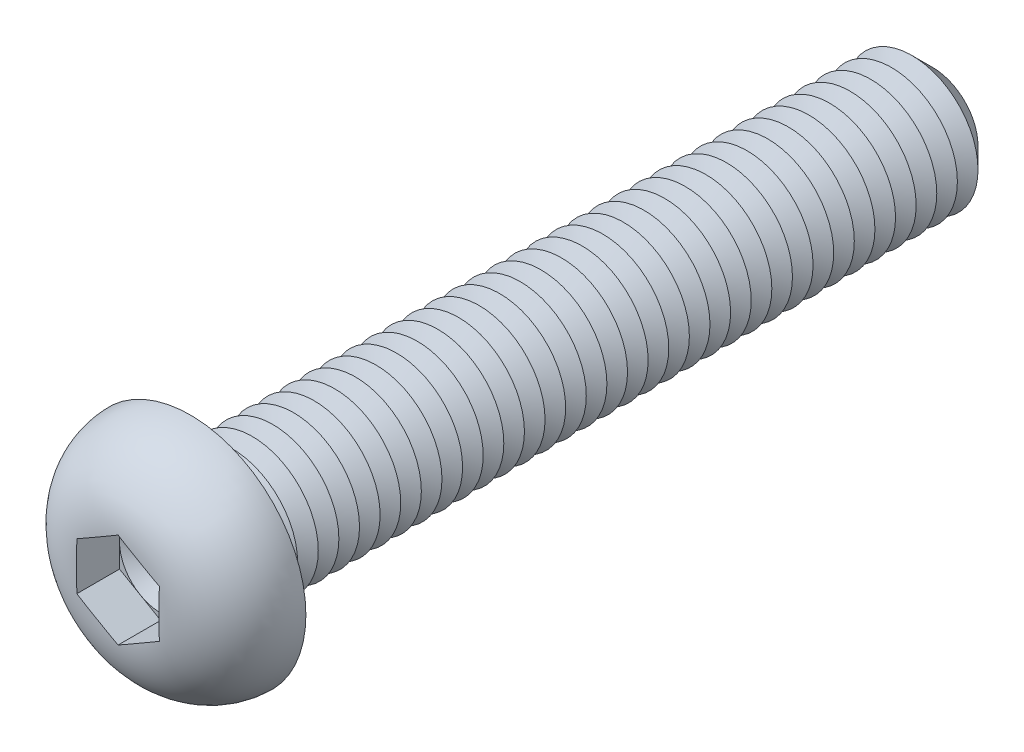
ISO-10303-21;
HEADER;
FILE_DESCRIPTION(('STEP AP214'),'2;1');
FILE_NAME('part.step','',(''),(''),'','','');
FILE_SCHEMA(('AUTOMOTIVE_DESIGN { 1 0 10303 214 1 1 1 1 }'));
ENDSEC;
DATA;
#1=APPLICATION_CONTEXT('core data for automotive mechanical design processes');
#2=APPLICATION_PROTOCOL_DEFINITION('international standard','automotive_design',2000,#1);
#3=PRODUCT_CONTEXT('',#1,'mechanical');
#4=PRODUCT('Part','Part','',(#3));
#5=PRODUCT_RELATED_PRODUCT_CATEGORY('part','',(#4));
#6=PRODUCT_DEFINITION_FORMATION('','',#4);
#7=PRODUCT_DEFINITION_CONTEXT('part definition',#1,'design');
#8=PRODUCT_DEFINITION('design','',#6,#7);
#9=PRODUCT_DEFINITION_SHAPE('','',#8);
#10=(LENGTH_UNIT() NAMED_UNIT(*) SI_UNIT(.MILLI.,.METRE.));
#11=(NAMED_UNIT(*) PLANE_ANGLE_UNIT() SI_UNIT($,.RADIAN.));
#12=(NAMED_UNIT(*) SI_UNIT($,.STERADIAN.) SOLID_ANGLE_UNIT());
#13=UNCERTAINTY_MEASURE_WITH_UNIT(LENGTH_MEASURE(1.E-05),#10,'distance_accuracy_value','');
#14=(GEOMETRIC_REPRESENTATION_CONTEXT(3) GLOBAL_UNCERTAINTY_ASSIGNED_CONTEXT((#13)) GLOBAL_UNIT_ASSIGNED_CONTEXT((#10,
#11,#12)) REPRESENTATION_CONTEXT('',''));
#15=CARTESIAN_POINT('',(0.,0.,0.));
#16=DIRECTION('',(0.,0.,1.));
#17=DIRECTION('',(1.,0.,0.));
#18=AXIS2_PLACEMENT_3D('',#15,#16,#17);
#19=CARTESIAN_POINT('',(0.,0.,1.8));
#20=DIRECTION('',(0.,0.,1.));
#21=DIRECTION('',(1.,0.,0.));
#22=AXIS2_PLACEMENT_3D('',#19,#20,#21);
#23=PLANE('',#22);
#24=CARTESIAN_POINT('',(0.,0.,1.8));
#25=DIRECTION('',(0.,0.,1.));
#26=DIRECTION('',(1.,0.,0.));
#27=AXIS2_PLACEMENT_3D('',#24,#25,#26);
#28=CIRCLE('',#27,2.5);
#29=CARTESIAN_POINT('',(2.5,0.,1.8));
#30=VERTEX_POINT('',#29);
#31=CARTESIAN_POINT('',(1.25,2.1650635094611,1.8));
#32=VERTEX_POINT('',#31);
#33=EDGE_CURVE('E153',#30,#32,#28,.T.);
#34=ORIENTED_EDGE('',*,*,#33,.F.);
#35=DIRECTION('',(0.,1.,0.));
#36=VECTOR('',#35,1.);
#37=CARTESIAN_POINT('',(2.5,-1.44337567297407,1.8));
#38=LINE('',#37,#36);
#39=CARTESIAN_POINT('',(2.5,1.44337567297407,1.8));
#40=VERTEX_POINT('',#39);
#41=EDGE_CURVE('E176',#30,#40,#38,.T.);
#42=ORIENTED_EDGE('',*,*,#41,.T.);
#43=DIRECTION('',(-0.866025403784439,0.5,0.));
#44=VECTOR('',#43,1.);
#45=CARTESIAN_POINT('',(2.5,1.44337567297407,1.8));
#46=LINE('',#45,#44);
#47=EDGE_CURVE('E172',#40,#32,#46,.T.);
#48=ORIENTED_EDGE('',*,*,#47,.T.);
#49=EDGE_LOOP('',(#34,#42,#48));
#50=FACE_BOUND('',#49,.T.);
#51=ADVANCED_FACE('F39',(#50),#23,.T.);
#52=CARTESIAN_POINT('',(0.,0.,1.8));
#53=DIRECTION('',(0.,0.,1.));
#54=DIRECTION('',(1.,0.,0.));
#55=AXIS2_PLACEMENT_3D('',#52,#53,#54);
#56=CIRCLE('',#55,2.5);
#57=CARTESIAN_POINT('',(-1.25,2.1650635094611,1.8));
#58=VERTEX_POINT('',#57);
#59=EDGE_CURVE('E11',#32,#58,#56,.T.);
#60=ORIENTED_EDGE('',*,*,#59,.F.);
#61=CARTESIAN_POINT('',(0.,2.88675134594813,1.8));
#62=VERTEX_POINT('',#61);
#63=EDGE_CURVE('E166',#32,#62,#46,.T.);
#64=ORIENTED_EDGE('',*,*,#63,.T.);
#65=DIRECTION('',(-0.866025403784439,-0.5,0.));
#66=VECTOR('',#65,1.);
#67=CARTESIAN_POINT('',(0.,2.88675134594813,1.8));
#68=LINE('',#67,#66);
#69=EDGE_CURVE('E167',#62,#58,#68,.T.);
#70=ORIENTED_EDGE('',*,*,#69,.T.);
#71=EDGE_LOOP('',(#60,#64,#70));
#72=FACE_BOUND('',#71,.T.);
#73=ADVANCED_FACE('F165',(#72),#23,.T.);
#74=CARTESIAN_POINT('',(-2.5,0.,1.8));
#75=VERTEX_POINT('',#74);
#76=EDGE_CURVE('E49',#58,#75,#56,.T.);
#77=ORIENTED_EDGE('',*,*,#76,.F.);
#78=CARTESIAN_POINT('',(-2.5,1.44337567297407,1.8));
#79=VERTEX_POINT('',#78);
#80=EDGE_CURVE('E179',#58,#79,#68,.T.);
#81=ORIENTED_EDGE('',*,*,#80,.T.);
#82=DIRECTION('',(0.,-1.,0.));
#83=VECTOR('',#82,1.);
#84=CARTESIAN_POINT('',(-2.5,1.44337567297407,1.8));
#85=LINE('',#84,#83);
#86=EDGE_CURVE('E190',#79,#75,#85,.T.);
#87=ORIENTED_EDGE('',*,*,#86,.T.);
#88=EDGE_LOOP('',(#77,#81,#87));
#89=FACE_BOUND('',#88,.T.);
#90=ADVANCED_FACE('F441',(#89),#23,.T.);
#91=CARTESIAN_POINT('',(-1.25,-2.1650635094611,1.8));
#92=VERTEX_POINT('',#91);
#93=EDGE_CURVE('E423',#75,#92,#56,.T.);
#94=ORIENTED_EDGE('',*,*,#93,.F.);
#95=CARTESIAN_POINT('',(-2.5,-1.44337567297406,1.8));
#96=VERTEX_POINT('',#95);
#97=EDGE_CURVE('E189',#75,#96,#85,.T.);
#98=ORIENTED_EDGE('',*,*,#97,.T.);
#99=DIRECTION('',(0.866025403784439,-0.5,0.));
#100=VECTOR('',#99,1.);
#101=CARTESIAN_POINT('',(-2.5,-1.44337567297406,1.8));
#102=LINE('',#101,#100);
#103=EDGE_CURVE('E195',#96,#92,#102,.T.);
#104=ORIENTED_EDGE('',*,*,#103,.T.);
#105=EDGE_LOOP('',(#94,#98,#104));
#106=FACE_BOUND('',#105,.T.);
#107=ADVANCED_FACE('F435',(#106),#23,.T.);
#108=CARTESIAN_POINT('',(1.25,-2.1650635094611,1.8));
#109=VERTEX_POINT('',#108);
#110=EDGE_CURVE('E56',#92,#109,#56,.T.);
#111=ORIENTED_EDGE('',*,*,#110,.F.);
#112=CARTESIAN_POINT('',(0.,-2.88675134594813,1.8));
#113=VERTEX_POINT('',#112);
#114=EDGE_CURVE('E194',#92,#113,#102,.T.);
#115=ORIENTED_EDGE('',*,*,#114,.T.);
#116=DIRECTION('',(0.866025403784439,0.5,0.));
#117=VECTOR('',#116,1.);
#118=CARTESIAN_POINT('',(0.,-2.88675134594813,1.8));
#119=LINE('',#118,#117);
#120=EDGE_CURVE('E200',#113,#109,#119,.T.);
#121=ORIENTED_EDGE('',*,*,#120,.T.);
#122=EDGE_LOOP('',(#111,#115,#121));
#123=FACE_BOUND('',#122,.T.);
#124=ADVANCED_FACE('F477',(#123),#23,.T.);
#125=CARTESIAN_POINT('',(0.,0.,-45.));
#126=DIRECTION('',(0.,0.,1.));
#127=DIRECTION('',(1.,0.,0.));
#128=AXIS2_PLACEMENT_3D('',#125,#126,#127);
#129=CYLINDRICAL_SURFACE('',#128,4.);
#130=CARTESIAN_POINT('',(0.,0.,-0.5));
#131=DIRECTION('',(0.,0.,1.));
#132=DIRECTION('',(1.,0.,0.));
#133=AXIS2_PLACEMENT_3D('',#130,#131,#132);
#134=CIRCLE('',#133,4.);
#135=CARTESIAN_POINT('',(4.,0.,-0.500000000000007));
#136=VERTEX_POINT('',#135);
#137=EDGE_CURVE('E411',#136,#136,#134,.F.);
#138=CARTESIAN_POINT('',(0.,0.,-1.25));
#139=DIRECTION('',(0.,0.,1.));
#140=DIRECTION('',(1.,0.,0.));
#141=AXIS2_PLACEMENT_3D('',#138,#139,#140);
#142=CIRCLE('',#141,4.00000000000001);
#143=CARTESIAN_POINT('',(4.,0.,-1.25000000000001));
#144=VERTEX_POINT('',#143);
#145=EDGE_CURVE('E185',#144,#144,#142,.T.);
#146=CARTESIAN_POINT('',(4.,0.,-0.500000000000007));
#147=CARTESIAN_POINT('',(4.,0.,-0.507812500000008));
#148=CARTESIAN_POINT('',(4.,0.,-0.515625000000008));
#149=CARTESIAN_POINT('',(4.,0.,-0.531250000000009));
#150=CARTESIAN_POINT('',(4.,0.,-0.539062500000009));
#151=CARTESIAN_POINT('',(4.,0.,-0.554687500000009));
#152=CARTESIAN_POINT('',(4.,0.,-0.56250000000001));
#153=CARTESIAN_POINT('',(4.,0.,-0.57812500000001));
#154=CARTESIAN_POINT('',(4.,0.,-0.585937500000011));
#155=CARTESIAN_POINT('',(4.,0.,-0.601562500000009));
#156=CARTESIAN_POINT('',(4.,0.,-0.609375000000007));
#157=CARTESIAN_POINT('',(4.,0.,-0.625000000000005));
#158=CARTESIAN_POINT('',(4.,0.,-0.632812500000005));
#159=CARTESIAN_POINT('',(4.,0.,-0.648437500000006));
#160=CARTESIAN_POINT('',(4.,0.,-0.656250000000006));
#161=CARTESIAN_POINT('',(4.,0.,-0.671875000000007));
#162=CARTESIAN_POINT('',(4.,0.,-0.679687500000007));
#163=CARTESIAN_POINT('',(4.,0.,-0.695312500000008));
#164=CARTESIAN_POINT('',(4.,0.,-0.703125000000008));
#165=CARTESIAN_POINT('',(4.,0.,-0.718750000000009));
#166=CARTESIAN_POINT('',(4.,0.,-0.726562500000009));
#167=CARTESIAN_POINT('',(4.,0.,-0.74218750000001));
#168=CARTESIAN_POINT('',(4.,0.,-0.75000000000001));
#169=CARTESIAN_POINT('',(4.,0.,-0.765625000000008));
#170=CARTESIAN_POINT('',(4.,0.,-0.773437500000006));
#171=CARTESIAN_POINT('',(4.,0.,-0.789062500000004));
#172=CARTESIAN_POINT('',(4.,0.,-0.796875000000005));
#173=CARTESIAN_POINT('',(4.,0.,-0.812500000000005));
#174=CARTESIAN_POINT('',(4.,0.,-0.820312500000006));
#175=CARTESIAN_POINT('',(4.,0.,-0.835937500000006));
#176=CARTESIAN_POINT('',(4.,0.,-0.843750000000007));
#177=CARTESIAN_POINT('',(4.,0.,-0.859375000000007));
#178=CARTESIAN_POINT('',(4.,0.,-0.867187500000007));
#179=CARTESIAN_POINT('',(4.,0.,-0.882812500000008));
#180=CARTESIAN_POINT('',(4.,0.,-0.890625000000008));
#181=CARTESIAN_POINT('',(4.,0.,-0.906250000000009));
#182=CARTESIAN_POINT('',(4.,0.,-0.914062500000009));
#183=CARTESIAN_POINT('',(4.,0.,-0.92968750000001));
#184=CARTESIAN_POINT('',(4.,0.,-0.93750000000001));
#185=CARTESIAN_POINT('',(4.,0.,-0.953125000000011));
#186=CARTESIAN_POINT('',(4.,0.,-0.960937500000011));
#187=CARTESIAN_POINT('',(4.,0.,-0.976562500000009));
#188=CARTESIAN_POINT('',(4.,0.,-0.984375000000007));
#189=CARTESIAN_POINT('',(4.,0.,-1.00000000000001));
#190=CARTESIAN_POINT('',(4.,0.,-1.00781250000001));
#191=CARTESIAN_POINT('',(4.,0.,-1.02343750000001));
#192=CARTESIAN_POINT('',(4.,0.,-1.03125000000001));
#193=CARTESIAN_POINT('',(4.,0.,-1.04687500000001));
#194=CARTESIAN_POINT('',(4.,0.,-1.05468750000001));
#195=CARTESIAN_POINT('',(4.,0.,-1.07031250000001));
#196=CARTESIAN_POINT('',(4.,0.,-1.07812500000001));
#197=CARTESIAN_POINT('',(4.,0.,-1.09375000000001));
#198=CARTESIAN_POINT('',(4.,0.,-1.10156250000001));
#199=CARTESIAN_POINT('',(4.,0.,-1.11718750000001));
#200=CARTESIAN_POINT('',(4.,0.,-1.12500000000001));
#201=CARTESIAN_POINT('',(4.,0.,-1.14062500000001));
#202=CARTESIAN_POINT('',(4.,0.,-1.14843750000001));
#203=CARTESIAN_POINT('',(4.,0.,-1.1640625));
#204=CARTESIAN_POINT('',(4.,0.,-1.17187500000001));
#205=CARTESIAN_POINT('',(4.,0.,-1.18750000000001));
#206=CARTESIAN_POINT('',(4.,0.,-1.19531250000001));
#207=CARTESIAN_POINT('',(4.,0.,-1.21093750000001));
#208=CARTESIAN_POINT('',(4.,0.,-1.21875000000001));
#209=CARTESIAN_POINT('',(4.,0.,-1.23437500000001));
#210=CARTESIAN_POINT('',(4.,0.,-1.24218750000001));
#211=CARTESIAN_POINT('',(4.,0.,-1.25000000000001));
#212=B_SPLINE_CURVE_WITH_KNOTS('',3,(#146,#147,#148,#149,#150,#151,#152,#153,#154,#155,#156,
#157,#158,#159,#160,#161,#162,#163,#164,#165,#166,#167,#168,#169,#170,#171,#172,#173,#174,#175,
#176,#177,#178,#179,#180,#181,#182,#183,#184,#185,#186,#187,#188,#189,#190,#191,#192,#193,#194,
#195,#196,#197,#198,#199,#200,#201,#202,#203,#204,#205,#206,#207,#208,#209,#210,#211),
.UNSPECIFIED.,.F.,.F.,(4,2,2,2,2,2,2,2,2,2,2,2,2,2,2,2,2,2,2,2,2,2,2,2,2,2,2,2,2,2,2,2,4),(0.,
0.0234375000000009,0.0468750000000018,0.0703125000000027,0.0937500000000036,0.117187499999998,
0.140624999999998,0.164062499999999,0.1875,0.210937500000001,0.234375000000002,
0.257812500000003,0.281249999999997,0.304687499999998,0.328124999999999,0.351562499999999,0.375,
0.398437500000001,0.421875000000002,0.445312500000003,0.468750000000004,0.492187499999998,
0.515624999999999,0.5390625,0.5625,0.585937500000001,0.609375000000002,0.632812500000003,
0.656249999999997,0.679687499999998,0.703124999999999,0.7265625,0.750000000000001),.UNSPECIFIED.);
#213=EDGE_CURVE('BSEAM472',#136,#144,#212,.T.);
#214=ORIENTED_EDGE('',*,*,#137,.T.);
#215=ORIENTED_EDGE('',*,*,#145,.T.);
#216=ORIENTED_EDGE('',*,*,#213,.T.);
#217=ORIENTED_EDGE('',*,*,#213,.F.);
#218=EDGE_LOOP('',(#214,#216,#215,#217));
#219=FACE_BOUND('',#218,.T.);
#220=ADVANCED_FACE('F472',(#219),#129,.T.);
#221=CARTESIAN_POINT('',(0.,7.,0.));
#222=DIRECTION('',(0.,0.,1.));
#223=DIRECTION('',(1.,0.,0.));
#224=AXIS2_PLACEMENT_3D('',#221,#222,#223);
#225=PLANE('',#224);
#226=CARTESIAN_POINT('',(0.,0.,0.));
#227=DIRECTION('',(0.,0.,1.));
#228=DIRECTION('',(1.,0.,0.));
#229=AXIS2_PLACEMENT_3D('',#226,#227,#228);
#230=CIRCLE('',#229,4.5);
#231=CARTESIAN_POINT('',(4.5,0.,0.));
#232=VERTEX_POINT('',#231);
#233=EDGE_CURVE('E414',#232,#232,#230,.T.);
#234=ORIENTED_EDGE('',*,*,#233,.T.);
#235=EDGE_LOOP('',(#234));
#236=FACE_BOUND('',#235,.T.);
#237=CARTESIAN_POINT('',(0.,0.,0.));
#238=DIRECTION('',(0.,0.,1.));
#239=DIRECTION('',(1.,0.,0.));
#240=AXIS2_PLACEMENT_3D('',#237,#238,#239);
#241=CIRCLE('',#240,7.);
#242=CARTESIAN_POINT('',(7.,0.,0.));
#243=VERTEX_POINT('',#242);
#244=EDGE_CURVE('E211',#243,#243,#241,.T.);
#245=ORIENTED_EDGE('',*,*,#244,.F.);
#246=EDGE_LOOP('',(#245));
#247=FACE_BOUND('',#246,.T.);
#248=ADVANCED_FACE('F470',(#236,#247),#225,.F.);
#249=CARTESIAN_POINT('',(0.,0.,-0.1));
#250=DIRECTION('',(0.,0.,1.));
#251=DIRECTION('',(1.,0.,0.));
#252=AXIS2_PLACEMENT_3D('',#249,#250,#251);
#253=DEGENERATE_TOROIDAL_SURFACE('',#252,2.5011112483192,4.5,.T.);
#254=CARTESIAN_POINT('',(1.31456088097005,2.12778926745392,4.4));
#255=DIRECTION('',(-0.866025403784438,0.500000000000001,0.));
#256=VECTOR('',#255,1.);
#257=LINE('',#254,#256);
#258=CARTESIAN_POINT('',(1.31456088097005,2.12778926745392,4.4));
#259=VERTEX_POINT('',#258);
#260=CARTESIAN_POINT('',(1.18543911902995,2.20233775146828,4.4));
#261=VERTEX_POINT('',#260);
#262=EDGE_CURVE('E399',#259,#261,#257,.T.);
#263=ORIENTED_EDGE('',*,*,#262,.F.);
#264=CARTESIAN_POINT('',(-0.000200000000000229,2.88686681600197,4.38343536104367));
#265=CARTESIAN_POINT('',(0.103935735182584,2.82674402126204,4.38859262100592));
#266=CARTESIAN_POINT('',(0.208111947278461,2.76659785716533,4.39207570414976));
#267=CARTESIAN_POINT('',(0.416486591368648,2.64629270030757,4.39683754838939));
#268=CARTESIAN_POINT('',(0.520685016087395,2.58613371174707,4.39811670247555));
#269=CARTESIAN_POINT('',(0.729066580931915,2.46582455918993,4.3996156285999));
#270=CARTESIAN_POINT('',(0.833249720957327,2.40567439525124,4.39983556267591));
#271=CARTESIAN_POINT('',(1.04162190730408,2.2853706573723,4.4000276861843));
#272=CARTESIAN_POINT('',(1.14581095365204,2.2252170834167,4.39999986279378));
#273=CARTESIAN_POINT('',(1.35418904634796,2.10490993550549,4.39999986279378));
#274=CARTESIAN_POINT('',(1.45837809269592,2.04475636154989,4.4000276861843));
#275=CARTESIAN_POINT('',(1.66675027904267,1.92445262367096,4.39983556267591));
#276=CARTESIAN_POINT('',(1.77093341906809,1.86430245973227,4.3996156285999));
#277=CARTESIAN_POINT('',(1.97931498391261,1.74399330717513,4.39811670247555));
#278=CARTESIAN_POINT('',(2.08351340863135,1.68383431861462,4.39683754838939));
#279=CARTESIAN_POINT('',(2.29188805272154,1.56352916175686,4.39207570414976));
#280=CARTESIAN_POINT('',(2.39606426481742,1.50338299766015,4.38859262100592));
#281=CARTESIAN_POINT('',(2.5002,1.44326020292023,4.38343536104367));
#282=B_SPLINE_CURVE_WITH_KNOTS('',3,(#264,#265,#266,#267,#268,#269,#270,#271,#272,#273,#274,
#275,#276,#277,#278,#279,#280,#281),.UNSPECIFIED.,.F.,.F.,(4,2,2,2,2,2,2,2,4),(0.,
0.361022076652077,0.721979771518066,1.08288224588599,1.44380339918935,1.80472455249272,
2.16562702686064,2.52658472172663,2.88760679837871),.UNSPECIFIED.);
#283=CARTESIAN_POINT('',(2.5,1.44337567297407,4.38344529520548));
#284=VERTEX_POINT('',#283);
#285=EDGE_CURVE('E355',#259,#284,#282,.T.);
#286=ORIENTED_EDGE('',*,*,#285,.T.);
#287=CARTESIAN_POINT('',(2.5,0.,4.39999986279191));
#288=CARTESIAN_POINT('',(2.5,-0.104697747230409,4.39999811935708));
#289=CARTESIAN_POINT('',(2.5,-0.209395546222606,4.40001551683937));
#290=CARTESIAN_POINT('',(2.5,-0.418792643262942,4.39990807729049));
#291=CARTESIAN_POINT('',(2.5,-0.52349194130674,4.39978323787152));
#292=CARTESIAN_POINT('',(2.5,-0.732936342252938,4.39891238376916));
#293=CARTESIAN_POINT('',(2.5,-0.837681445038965,4.39816609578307));
#294=CARTESIAN_POINT('',(2.5,-1.04715282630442,4.39536239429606));
#295=CARTESIAN_POINT('',(2.5,-1.15187910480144,4.39330498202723));
#296=CARTESIAN_POINT('',(2.5,-1.46476484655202,4.38400647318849));
#297=CARTESIAN_POINT('',(2.5,-1.67286375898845,4.37365196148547));
#298=CARTESIAN_POINT('',(2.5,-2.08783281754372,4.33852954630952));
#299=CARTESIAN_POINT('',(2.5,-2.29470379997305,4.31377296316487));
#300=CARTESIAN_POINT('',(2.5,-2.64451002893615,4.25536510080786));
#301=CARTESIAN_POINT('',(2.5,-2.78823975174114,4.22651785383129));
#302=CARTESIAN_POINT('',(2.5,-3.073224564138,4.15827060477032));
#303=CARTESIAN_POINT('',(2.5,-3.21447933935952,4.11886927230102));
#304=CARTESIAN_POINT('',(2.5,-3.49353952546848,4.02870287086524));
#305=CARTESIAN_POINT('',(2.5,-3.6313402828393,3.97792330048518));
#306=CARTESIAN_POINT('',(2.5,-3.90204977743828,3.86463774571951));
#307=CARTESIAN_POINT('',(2.5,-4.0349587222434,3.8021322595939));
#308=CARTESIAN_POINT('',(2.5,-4.2956525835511,3.66474880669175));
#309=CARTESIAN_POINT('',(2.5,-4.42338586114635,3.58977252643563));
#310=CARTESIAN_POINT('',(2.5,-4.67118559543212,3.42803136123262));
#311=CARTESIAN_POINT('',(2.5,-4.79125159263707,3.3412657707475));
#312=CARTESIAN_POINT('',(2.5,-5.02233156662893,3.15645800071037));
#313=CARTESIAN_POINT('',(2.5,-5.13334771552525,3.05841854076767));
#314=CARTESIAN_POINT('',(2.5,-5.34506083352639,2.85177471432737));
#315=CARTESIAN_POINT('',(2.5,-5.44575933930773,2.74317192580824));
#316=CARTESIAN_POINT('',(2.5,-5.62335564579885,2.53102225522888));
#317=CARTESIAN_POINT('',(2.5,-5.70164721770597,2.42863868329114));
#318=CARTESIAN_POINT('',(2.5,-5.84882394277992,2.21725758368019));
#319=CARTESIAN_POINT('',(2.5,-5.91770588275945,2.10825781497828));
#320=CARTESIAN_POINT('',(2.5,-6.04532926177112,1.88460009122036));
#321=CARTESIAN_POINT('',(2.5,-6.1040794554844,1.76994713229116));
#322=CARTESIAN_POINT('',(2.5,-6.21098181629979,1.53574793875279));
#323=CARTESIAN_POINT('',(2.5,-6.25913021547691,1.41619998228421));
#324=CARTESIAN_POINT('',(2.5,-6.34173830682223,1.18065209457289));
#325=CARTESIAN_POINT('',(2.5,-6.37685491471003,1.06488207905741));
#326=CARTESIAN_POINT('',(2.5,-6.43703913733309,0.830714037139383));
#327=CARTESIAN_POINT('',(2.5,-6.46210319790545,0.712315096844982));
#328=CARTESIAN_POINT('',(2.5,-6.50194044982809,0.473848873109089));
#329=CARTESIAN_POINT('',(2.5,-6.51671856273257,0.353782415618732));
#330=CARTESIAN_POINT('',(2.5,-6.53588982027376,0.112808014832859));
#331=CARTESIAN_POINT('',(2.5,-6.54027911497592,-0.00810022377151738));
#332=CARTESIAN_POINT('',(2.5,-6.53779027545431,-0.365870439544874));
#333=CARTESIAN_POINT('',(2.5,-6.51607942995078,-0.602790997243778));
#334=CARTESIAN_POINT('',(2.5,-6.43310265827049,-1.06957107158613));
#335=CARTESIAN_POINT('',(2.5,-6.3718398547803,-1.29943114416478));
#336=CARTESIAN_POINT('',(2.5,-6.25195024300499,-1.63390601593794));
#337=CARTESIAN_POINT('',(2.5,-6.20730237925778,-1.74371189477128));
#338=CARTESIAN_POINT('',(2.5,-6.10902350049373,-1.95921136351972));
#339=CARTESIAN_POINT('',(2.5,-6.05539567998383,-2.06490639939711));
#340=CARTESIAN_POINT('',(2.5,-5.93955620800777,-2.27152527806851));
#341=CARTESIAN_POINT('',(2.5,-5.87734126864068,-2.37244727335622));
#342=CARTESIAN_POINT('',(2.5,-5.7448545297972,-2.56880727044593));
#343=CARTESIAN_POINT('',(2.5,-5.67458537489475,-2.6642470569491));
#344=CARTESIAN_POINT('',(2.5,-5.52523018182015,-2.85070592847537));
#345=CARTESIAN_POINT('',(2.5,-5.44601185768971,-2.94161901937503));
#346=CARTESIAN_POINT('',(2.5,-5.28044044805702,-3.11663859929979));
#347=CARTESIAN_POINT('',(2.5,-5.194089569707,-3.2007471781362));
#348=CARTESIAN_POINT('',(2.5,-5.01485870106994,-3.36178408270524));
#349=CARTESIAN_POINT('',(2.5,-4.92197538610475,-3.43870870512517));
#350=CARTESIAN_POINT('',(2.5,-4.73045535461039,-3.58495812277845));
#351=CARTESIAN_POINT('',(2.5,-4.6318202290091,-3.65428500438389));
#352=CARTESIAN_POINT('',(2.5,-4.4247626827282,-3.78818551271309));
#353=CARTESIAN_POINT('',(2.5,-4.31609824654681,-3.85238474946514));
#354=CARTESIAN_POINT('',(2.5,-4.0940582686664,-3.97208975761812));
#355=CARTESIAN_POINT('',(2.5,-3.98068153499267,-4.02759331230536));
#356=CARTESIAN_POINT('',(2.5,-3.75029026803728,-4.12981004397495));
#357=CARTESIAN_POINT('',(2.5,-3.63328275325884,-4.17653908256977));
#358=CARTESIAN_POINT('',(2.5,-3.39631992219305,-4.2614893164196));
#359=CARTESIAN_POINT('',(2.5,-3.27636651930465,-4.29971587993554));
#360=CARTESIAN_POINT('',(2.5,-3.00446622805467,-4.37644925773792));
#361=CARTESIAN_POINT('',(2.5,-2.85188931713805,-4.41272455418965));
#362=CARTESIAN_POINT('',(2.5,-2.54443794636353,-4.47385449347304));
#363=CARTESIAN_POINT('',(2.5,-2.3895624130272,-4.49870361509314));
#364=CARTESIAN_POINT('',(2.5,-2.07807451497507,-4.53870829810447));
#365=CARTESIAN_POINT('',(2.5,-1.92145805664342,-4.55383091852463));
#366=CARTESIAN_POINT('',(2.5,-1.60772330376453,-4.57647936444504));
#367=CARTESIAN_POINT('',(2.5,-1.45060502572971,-4.58400543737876));
#368=CARTESIAN_POINT('',(2.5,-1.13432460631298,-4.59416656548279));
#369=CARTESIAN_POINT('',(2.5,-0.975160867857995,-4.59674096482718));
#370=CARTESIAN_POINT('',(2.5,-0.656826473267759,-4.59957813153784));
#371=CARTESIAN_POINT('',(2.5,-0.497655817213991,-4.59984092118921));
#372=CARTESIAN_POINT('',(2.5,-0.179547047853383,-4.60005428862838));
#373=CARTESIAN_POINT('',(2.5,-0.02060893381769,-4.60000532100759));
#374=CARTESIAN_POINT('',(2.5,0.297265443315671,-4.59999304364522));
#375=CARTESIAN_POINT('',(2.5,0.456201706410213,-4.60002973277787));
#376=CARTESIAN_POINT('',(2.5,0.70967559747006,-4.59902611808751));
#377=CARTESIAN_POINT('',(2.5,0.804213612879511,-4.59841616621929));
#378=CARTESIAN_POINT('',(2.5,0.99327694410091,-4.59620676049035));
#379=CARTESIAN_POINT('',(2.5,1.08780225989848,-4.59460730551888));
#380=CARTESIAN_POINT('',(2.5,1.37137837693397,-4.58746770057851));
#381=CARTESIAN_POINT('',(2.5,1.56039301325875,-4.57958602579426));
#382=CARTESIAN_POINT('',(2.5,1.93609462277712,-4.55305686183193));
#383=CARTESIAN_POINT('',(2.5,2.12278756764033,-4.53450331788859));
#384=CARTESIAN_POINT('',(2.5,2.49421016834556,-4.48296248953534));
#385=CARTESIAN_POINT('',(2.5,2.67894050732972,-4.44998040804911));
#386=CARTESIAN_POINT('',(2.5,2.99962701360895,-4.37718406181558));
#387=CARTESIAN_POINT('',(2.5,3.13641465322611,-4.34103978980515));
#388=CARTESIAN_POINT('',(2.5,3.40682838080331,-4.25834226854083));
#389=CARTESIAN_POINT('',(2.5,3.54045461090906,-4.21178948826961));
#390=CARTESIAN_POINT('',(2.5,3.80387940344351,-4.1076796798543));
#391=CARTESIAN_POINT('',(2.5,3.93366385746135,-4.05008679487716));
#392=CARTESIAN_POINT('',(2.5,4.18776789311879,-3.92385886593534));
#393=CARTESIAN_POINT('',(2.5,4.31208736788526,-3.85522360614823));
#394=CARTESIAN_POINT('',(2.5,4.55475418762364,-3.70660227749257));
#395=CARTESIAN_POINT('',(2.5,4.67306276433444,-3.62655275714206));
#396=CARTESIAN_POINT('',(2.5,4.90171316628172,-3.45576294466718));
#397=CARTESIAN_POINT('',(2.5,5.01205476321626,-3.36502234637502));
#398=CARTESIAN_POINT('',(2.5,5.22347091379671,-3.17353376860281));
#399=CARTESIAN_POINT('',(2.5,5.32455555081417,-3.07279693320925));
#400=CARTESIAN_POINT('',(2.5,5.51647993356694,-2.86200023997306));
#401=CARTESIAN_POINT('',(2.5,5.6073208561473,-2.75194145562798));
#402=CARTESIAN_POINT('',(2.5,5.76832451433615,-2.53607083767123));
#403=CARTESIAN_POINT('',(2.5,5.83966300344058,-2.4311337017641));
#404=CARTESIAN_POINT('',(2.5,5.97282702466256,-2.2153291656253));
#405=CARTESIAN_POINT('',(2.5,6.03464926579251,-2.10445973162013));
#406=CARTESIAN_POINT('',(2.5,6.14815657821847,-1.87771731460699));
#407=CARTESIAN_POINT('',(2.5,6.19984675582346,-1.76184688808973));
#408=CARTESIAN_POINT('',(2.5,6.29267395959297,-1.52590109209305));
#409=CARTESIAN_POINT('',(2.5,6.33380720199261,-1.40582423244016));
#410=CARTESIAN_POINT('',(2.5,6.40328888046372,-1.16869740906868));
#411=CARTESIAN_POINT('',(2.5,6.43218419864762,-1.05180738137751));
#412=CARTESIAN_POINT('',(2.5,6.47988151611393,-0.815941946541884));
#413=CARTESIAN_POINT('',(2.5,6.49867991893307,-0.696965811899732));
#414=CARTESIAN_POINT('',(2.5,6.52599950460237,-0.457898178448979));
#415=CARTESIAN_POINT('',(2.5,6.53452634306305,-0.337807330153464));
#416=CARTESIAN_POINT('',(2.5,6.54126106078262,-0.0973214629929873));
#417=CARTESIAN_POINT('',(2.5,6.5394651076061,0.023073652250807));
#418=CARTESIAN_POINT('',(2.5,6.51879545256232,0.379398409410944));
#419=CARTESIAN_POINT('',(2.5,6.48510560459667,0.614630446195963));
#420=CARTESIAN_POINT('',(2.5,6.37872360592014,1.07608887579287));
#421=CARTESIAN_POINT('',(2.5,6.30603128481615,1.3023152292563));
#422=CARTESIAN_POINT('',(2.5,6.16957161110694,1.63028303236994));
#423=CARTESIAN_POINT('',(2.5,6.11941470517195,1.7378698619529));
#424=CARTESIAN_POINT('',(2.5,6.01034124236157,1.94849153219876));
#425=CARTESIAN_POINT('',(2.5,5.9514277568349,2.05152795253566));
#426=CARTESIAN_POINT('',(2.5,5.82528890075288,2.25240256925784));
#427=CARTESIAN_POINT('',(2.5,5.75806159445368,2.35023954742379));
#428=CARTESIAN_POINT('',(2.5,5.61585543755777,2.54005689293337));
#429=CARTESIAN_POINT('',(2.5,5.54087908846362,2.63203913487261));
#430=CARTESIAN_POINT('',(2.5,5.38212190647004,2.81146438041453));
#431=CARTESIAN_POINT('',(2.5,5.29819182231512,2.89877528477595));
#432=CARTESIAN_POINT('',(2.5,5.12353712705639,3.06625194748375));
#433=CARTESIAN_POINT('',(2.5,5.03281455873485,3.14641983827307));
#434=CARTESIAN_POINT('',(2.5,4.84518171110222,3.29930665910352));
#435=CARTESIAN_POINT('',(2.5,4.74826657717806,3.37201962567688));
#436=CARTESIAN_POINT('',(2.5,4.54907485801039,3.50961479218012));
#437=CARTESIAN_POINT('',(2.5,4.44679969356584,3.57449905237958));
#438=CARTESIAN_POINT('',(2.5,4.23202545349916,3.69953578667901));
#439=CARTESIAN_POINT('',(2.5,4.11927203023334,3.75925114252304));
#440=CARTESIAN_POINT('',(2.5,3.88947986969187,3.86977617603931));
#441=CARTESIAN_POINT('',(2.5,3.77244067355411,3.92058489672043));
#442=CARTESIAN_POINT('',(2.5,3.5351804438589,4.0133148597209));
#443=CARTESIAN_POINT('',(2.5,3.41496637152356,4.0552539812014));
#444=CARTESIAN_POINT('',(2.5,3.17195278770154,4.13067246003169));
#445=CARTESIAN_POINT('',(2.5,3.04915378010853,4.16415344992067));
#446=CARTESIAN_POINT('',(2.5,2.80683027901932,4.22194717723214));
#447=CARTESIAN_POINT('',(2.5,2.68738216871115,4.2465834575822));
#448=CARTESIAN_POINT('',(2.5,2.44729214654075,4.28920746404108));
#449=CARTESIAN_POINT('',(2.5,2.32664997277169,4.30719369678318));
#450=CARTESIAN_POINT('',(2.5,2.08450864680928,4.33736171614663));
#451=CARTESIAN_POINT('',(2.5,1.9630086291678,4.3495363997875));
#452=CARTESIAN_POINT('',(2.5,1.71961501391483,4.36908103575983));
#453=CARTESIAN_POINT('',(2.5,1.59772134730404,4.37645009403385));
#454=CARTESIAN_POINT('',(2.5,1.35283283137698,4.38761579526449));
#455=CARTESIAN_POINT('',(2.5,1.22983679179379,4.39138420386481));
#456=CARTESIAN_POINT('',(2.5,0.983808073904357,4.3965493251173));
#457=CARTESIAN_POINT('',(2.5,0.860775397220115,4.3979461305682));
#458=CARTESIAN_POINT('',(2.5,0.614783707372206,4.39958107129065));
#459=CARTESIAN_POINT('',(2.5,0.491824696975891,4.3998199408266));
#460=CARTESIAN_POINT('',(2.5,0.245910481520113,4.40003035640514));
#461=CARTESIAN_POINT('',(2.5,0.122955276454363,4.4000019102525));
#462=CARTESIAN_POINT('',(2.5,0.,4.39999986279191));
#463=B_SPLINE_CURVE_WITH_KNOTS('',3,(#287,#288,#289,#290,#291,#292,#293,#294,#295,#296,#297,
#298,#299,#300,#301,#302,#303,#304,#305,#306,#307,#308,#309,#310,#311,#312,#313,#314,#315,#316,
#317,#318,#319,#320,#321,#322,#323,#324,#325,#326,#327,#328,#329,#330,#331,#332,#333,#334,#335,
#336,#337,#338,#339,#340,#341,#342,#343,#344,#345,#346,#347,#348,#349,#350,#351,#352,#353,#354,
#355,#356,#357,#358,#359,#360,#361,#362,#363,#364,#365,#366,#367,#368,#369,#370,#371,#372,#373,
#374,#375,#376,#377,#378,#379,#380,#381,#382,#383,#384,#385,#386,#387,#388,#389,#390,#391,#392,
#393,#394,#395,#396,#397,#398,#399,#400,#401,#402,#403,#404,#405,#406,#407,#408,#409,#410,#411,
#412,#413,#414,#415,#416,#417,#418,#419,#420,#421,#422,#423,#424,#425,#426,#427,#428,#429,#430,
#431,#432,#433,#434,#435,#436,#437,#438,#439,#440,#441,#442,#443,#444,#445,#446,#447,#448,#449,
#450,#451,#452,#453,#454,#455,#456,#457,#458,#459,#460,#461,#462),.UNSPECIFIED.,.T.,.F.,(4,2,2,
2,2,2,2,2,2,2,2,2,2,2,2,2,2,2,2,2,2,2,2,2,2,2,2,2,2,2,2,2,2,2,2,2,2,2,2,2,2,2,2,2,2,2,2,2,2,2,2,
2,2,2,2,2,2,2,2,2,2,2,2,2,2,2,2,2,2,2,2,2,2,2,2,2,2,2,2,2,2,2,2,2,2,2,2,4),(0.,
0.314093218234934,0.62819170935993,0.942428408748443,1.25666481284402,1.88144147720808,
2.50572771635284,2.94516878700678,3.38466527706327,3.82472511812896,4.26476626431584,
4.70845695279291,5.15217420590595,5.59578464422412,6.03932891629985,6.42549664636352,
6.81179591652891,7.19775970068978,7.58386043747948,7.94635637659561,8.30898036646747,
8.67143073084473,9.03401539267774,9.74414367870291,10.4542159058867,10.8094792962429,
11.1646165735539,11.5198902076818,11.8750475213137,12.2363927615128,12.597626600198,
12.9590456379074,13.3203651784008,13.698597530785,14.0769261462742,14.4545641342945,
14.8319630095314,15.3019396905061,15.7721432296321,16.2439309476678,16.715703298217,
17.1932187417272,17.6707295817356,18.1475442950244,18.6243527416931,18.9079682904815,
19.1915841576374,19.7589248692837,20.3213460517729,20.8835645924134,21.3076400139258,
21.731696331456,22.1571540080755,22.5826200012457,23.0105507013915,23.4384936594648,
23.8659647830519,24.2933867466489,24.6735755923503,25.0538956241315,25.4340234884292,
25.8142874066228,26.1750761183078,26.5359932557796,26.8967115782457,27.2575638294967,
27.9668653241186,28.6761699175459,29.0319382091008,29.3875820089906,29.7433087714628,
30.0989210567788,30.4618400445,30.8246503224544,31.1877485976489,31.5507511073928,
31.9331198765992,32.3155297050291,32.6971611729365,33.0787189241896,33.4443988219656,
33.8101607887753,34.1763686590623,34.54264464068,34.9117697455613,35.2808804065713,
35.6497569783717,36.0186227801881),.UNSPECIFIED.);
#464=CARTESIAN_POINT('',(2.5,0.0745484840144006,4.4));
#465=VERTEX_POINT('',#464);
#466=EDGE_CURVE('E345',#284,#465,#463,.T.);
#467=ORIENTED_EDGE('',*,*,#466,.T.);
#468=CARTESIAN_POINT('',(2.5,-0.0745484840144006,4.4));
#469=DIRECTION('',(0.,1.,0.));
#470=VECTOR('',#469,1.);
#471=LINE('',#468,#470);
#472=CARTESIAN_POINT('',(2.5,-0.0745484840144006,4.4));
#473=VERTEX_POINT('',#472);
#474=EDGE_CURVE('E174',#473,#465,#471,.T.);
#475=ORIENTED_EDGE('',*,*,#474,.F.);
#476=CARTESIAN_POINT('',(2.5,-1.44337567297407,4.38344529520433));
#477=VERTEX_POINT('',#476);
#478=EDGE_CURVE('E356',#473,#477,#463,.T.);
#479=ORIENTED_EDGE('',*,*,#478,.T.);
#480=CARTESIAN_POINT('',(2.5002,-1.44326020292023,4.38343536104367));
#481=CARTESIAN_POINT('',(2.39606426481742,-1.50338299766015,4.38859262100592));
#482=CARTESIAN_POINT('',(2.29188805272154,-1.56352916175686,4.39207570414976));
#483=CARTESIAN_POINT('',(2.08351340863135,-1.68383431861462,4.39683754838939));
#484=CARTESIAN_POINT('',(1.9793149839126,-1.74399330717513,4.39811670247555));
#485=CARTESIAN_POINT('',(1.77093341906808,-1.86430245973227,4.3996156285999));
#486=CARTESIAN_POINT('',(1.66675027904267,-1.92445262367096,4.39983556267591));
#487=CARTESIAN_POINT('',(1.45837809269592,-2.04475636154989,4.4000276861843));
#488=CARTESIAN_POINT('',(1.35418904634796,-2.10490993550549,4.39999986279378));
#489=CARTESIAN_POINT('',(1.14581095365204,-2.2252170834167,4.39999986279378));
#490=CARTESIAN_POINT('',(1.04162190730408,-2.2853706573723,4.4000276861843));
#491=CARTESIAN_POINT('',(0.833249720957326,-2.40567439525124,4.39983556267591));
#492=CARTESIAN_POINT('',(0.729066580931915,-2.46582455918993,4.3996156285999));
#493=CARTESIAN_POINT('',(0.520685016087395,-2.58613371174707,4.39811670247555));
#494=CARTESIAN_POINT('',(0.416486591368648,-2.64629270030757,4.39683754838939));
#495=CARTESIAN_POINT('',(0.208111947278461,-2.76659785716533,4.39207570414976));
#496=CARTESIAN_POINT('',(0.103935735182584,-2.82674402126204,4.38859262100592));
#497=CARTESIAN_POINT('',(-0.000200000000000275,-2.88686681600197,4.38343536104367));
#498=B_SPLINE_CURVE_WITH_KNOTS('',3,(#480,#481,#482,#483,#484,#485,#486,#487,#488,#489,#490,
#491,#492,#493,#494,#495,#496,#497),.UNSPECIFIED.,.F.,.F.,(4,2,2,2,2,2,2,2,4),(0.,
0.361022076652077,0.721979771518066,1.08288224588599,1.44380339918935,1.80472455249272,
2.16562702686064,2.52658472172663,2.88760679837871),.UNSPECIFIED.);
#499=CARTESIAN_POINT('',(1.31456088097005,-2.12778926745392,4.4));
#500=VERTEX_POINT('',#499);
#501=EDGE_CURVE('E332',#477,#500,#498,.T.);
#502=ORIENTED_EDGE('',*,*,#501,.T.);
#503=CARTESIAN_POINT('',(1.18543911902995,-2.20233775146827,4.4));
#504=DIRECTION('',(0.866025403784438,0.500000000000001,0.));
#505=VECTOR('',#504,1.);
#506=LINE('',#503,#505);
#507=CARTESIAN_POINT('',(1.18543911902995,-2.20233775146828,4.4));
#508=VERTEX_POINT('',#507);
#509=EDGE_CURVE('E341',#508,#500,#506,.T.);
#510=ORIENTED_EDGE('',*,*,#509,.F.);
#511=CARTESIAN_POINT('',(0.,-2.88675134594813,4.38344529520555));
#512=VERTEX_POINT('',#511);
#513=EDGE_CURVE('E295',#508,#512,#498,.T.);
#514=ORIENTED_EDGE('',*,*,#513,.T.);
#515=CARTESIAN_POINT('',(0.00019999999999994,-2.88686681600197,4.38343536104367));
#516=CARTESIAN_POINT('',(-0.103935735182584,-2.82674402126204,4.38859262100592));
#517=CARTESIAN_POINT('',(-0.208111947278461,-2.76659785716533,4.39207570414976));
#518=CARTESIAN_POINT('',(-0.416486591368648,-2.64629270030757,4.39683754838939));
#519=CARTESIAN_POINT('',(-0.520685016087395,-2.58613371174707,4.39811670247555));
#520=CARTESIAN_POINT('',(-0.729066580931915,-2.46582455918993,4.3996156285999));
#521=CARTESIAN_POINT('',(-0.833249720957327,-2.40567439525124,4.39983556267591));
#522=CARTESIAN_POINT('',(-1.04162190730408,-2.2853706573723,4.4000276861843));
#523=CARTESIAN_POINT('',(-1.14581095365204,-2.2252170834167,4.39999986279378));
#524=CARTESIAN_POINT('',(-1.35418904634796,-2.10490993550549,4.39999986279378));
#525=CARTESIAN_POINT('',(-1.45837809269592,-2.04475636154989,4.4000276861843));
#526=CARTESIAN_POINT('',(-1.66675027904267,-1.92445262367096,4.39983556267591));
#527=CARTESIAN_POINT('',(-1.77093341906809,-1.86430245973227,4.3996156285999));
#528=CARTESIAN_POINT('',(-1.97931498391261,-1.74399330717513,4.39811670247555));
#529=CARTESIAN_POINT('',(-2.08351340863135,-1.68383431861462,4.39683754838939));
#530=CARTESIAN_POINT('',(-2.29188805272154,-1.56352916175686,4.39207570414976));
#531=CARTESIAN_POINT('',(-2.39606426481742,-1.50338299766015,4.38859262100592));
#532=CARTESIAN_POINT('',(-2.5002,-1.44326020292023,4.38343536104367));
#533=B_SPLINE_CURVE_WITH_KNOTS('',3,(#515,#516,#517,#518,#519,#520,#521,#522,#523,#524,#525,
#526,#527,#528,#529,#530,#531,#532),.UNSPECIFIED.,.F.,.F.,(4,2,2,2,2,2,2,2,4),(0.,
0.361022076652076,0.721979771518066,1.08288224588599,1.44380339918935,1.80472455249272,
2.16562702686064,2.52658472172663,2.88760679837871),.UNSPECIFIED.);
#534=CARTESIAN_POINT('',(-1.18543911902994,-2.20233775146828,4.4));
#535=VERTEX_POINT('',#534);
#536=EDGE_CURVE('E285',#512,#535,#533,.T.);
#537=ORIENTED_EDGE('',*,*,#536,.T.);
#538=CARTESIAN_POINT('',(-1.31456088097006,-2.12778926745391,4.4));
#539=DIRECTION('',(0.86602540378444,-0.499999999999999,0.));
#540=VECTOR('',#539,1.);
#541=LINE('',#538,#540);
#542=CARTESIAN_POINT('',(-1.31456088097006,-2.12778926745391,4.4));
#543=VERTEX_POINT('',#542);
#544=EDGE_CURVE('E617',#543,#535,#541,.T.);
#545=ORIENTED_EDGE('',*,*,#544,.F.);
#546=CARTESIAN_POINT('',(-2.5,-1.44337567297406,4.38344529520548));
#547=VERTEX_POINT('',#546);
#548=EDGE_CURVE('E296',#543,#547,#533,.T.);
#549=ORIENTED_EDGE('',*,*,#548,.T.);
#550=CARTESIAN_POINT('',(-2.5,0.,4.39999986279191));
#551=CARTESIAN_POINT('',(-2.5,0.104697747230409,4.39999811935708));
#552=CARTESIAN_POINT('',(-2.5,0.209395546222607,4.40001551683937));
#553=CARTESIAN_POINT('',(-2.5,0.418792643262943,4.39990807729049));
#554=CARTESIAN_POINT('',(-2.5,0.523491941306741,4.39978323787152));
#555=CARTESIAN_POINT('',(-2.5,0.732936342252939,4.39891238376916));
#556=CARTESIAN_POINT('',(-2.5,0.837681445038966,4.39816609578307));
#557=CARTESIAN_POINT('',(-2.5,1.04715282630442,4.39536239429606));
#558=CARTESIAN_POINT('',(-2.5,1.15187910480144,4.39330498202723));
#559=CARTESIAN_POINT('',(-2.5,1.46476484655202,4.38400647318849));
#560=CARTESIAN_POINT('',(-2.5,1.67286375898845,4.37365196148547));
#561=CARTESIAN_POINT('',(-2.5,2.08783281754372,4.33852954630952));
#562=CARTESIAN_POINT('',(-2.5,2.29470379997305,4.31377296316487));
#563=CARTESIAN_POINT('',(-2.5,2.64451002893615,4.25536510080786));
#564=CARTESIAN_POINT('',(-2.5,2.78823975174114,4.22651785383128));
#565=CARTESIAN_POINT('',(-2.5,3.073224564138,4.15827060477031));
#566=CARTESIAN_POINT('',(-2.5,3.21447933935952,4.11886927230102));
#567=CARTESIAN_POINT('',(-2.5,3.49353952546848,4.02870287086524));
#568=CARTESIAN_POINT('',(-2.5,3.6313402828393,3.97792330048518));
#569=CARTESIAN_POINT('',(-2.5,3.90204977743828,3.8646377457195));
#570=CARTESIAN_POINT('',(-2.5,4.0349587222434,3.8021322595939));
#571=CARTESIAN_POINT('',(-2.5,4.2956525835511,3.66474880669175));
#572=CARTESIAN_POINT('',(-2.5,4.42338586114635,3.58977252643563));
#573=CARTESIAN_POINT('',(-2.5,4.67118559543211,3.42803136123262));
#574=CARTESIAN_POINT('',(-2.5,4.79125159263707,3.3412657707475));
#575=CARTESIAN_POINT('',(-2.5,5.02233156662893,3.15645800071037));
#576=CARTESIAN_POINT('',(-2.5,5.13334771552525,3.05841854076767));
#577=CARTESIAN_POINT('',(-2.5,5.34506083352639,2.85177471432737));
#578=CARTESIAN_POINT('',(-2.5,5.44575933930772,2.74317192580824));
#579=CARTESIAN_POINT('',(-2.5,5.62335564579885,2.53102225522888));
#580=CARTESIAN_POINT('',(-2.5,5.70164721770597,2.42863868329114));
#581=CARTESIAN_POINT('',(-2.5,5.84882394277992,2.21725758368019));
#582=CARTESIAN_POINT('',(-2.5,5.91770588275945,2.10825781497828));
#583=CARTESIAN_POINT('',(-2.5,6.04532926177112,1.88460009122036));
#584=CARTESIAN_POINT('',(-2.5,6.1040794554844,1.76994713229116));
#585=CARTESIAN_POINT('',(-2.5,6.21098181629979,1.53574793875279));
#586=CARTESIAN_POINT('',(-2.5,6.25913021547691,1.41619998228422));
#587=CARTESIAN_POINT('',(-2.5,6.34173830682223,1.18065209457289));
#588=CARTESIAN_POINT('',(-2.5,6.37685491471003,1.06488207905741));
#589=CARTESIAN_POINT('',(-2.5,6.43703913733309,0.830714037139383));
#590=CARTESIAN_POINT('',(-2.5,6.46210319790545,0.712315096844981));
#591=CARTESIAN_POINT('',(-2.5,6.50194044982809,0.473848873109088));
#592=CARTESIAN_POINT('',(-2.5,6.51671856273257,0.35378241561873));
#593=CARTESIAN_POINT('',(-2.5,6.53588982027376,0.112808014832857));
#594=CARTESIAN_POINT('',(-2.5,6.54027911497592,-0.00810022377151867));
#595=CARTESIAN_POINT('',(-2.5,6.53779027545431,-0.365870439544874));
#596=CARTESIAN_POINT('',(-2.5,6.51607942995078,-0.602790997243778));
#597=CARTESIAN_POINT('',(-2.5,6.43310265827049,-1.06957107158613));
#598=CARTESIAN_POINT('',(-2.5,6.3718398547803,-1.29943114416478));
#599=CARTESIAN_POINT('',(-2.5,6.25195024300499,-1.63390601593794));
#600=CARTESIAN_POINT('',(-2.5,6.20730237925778,-1.74371189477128));
#601=CARTESIAN_POINT('',(-2.5,6.10902350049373,-1.95921136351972));
#602=CARTESIAN_POINT('',(-2.5,6.05539567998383,-2.06490639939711));
#603=CARTESIAN_POINT('',(-2.5,5.93955620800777,-2.27152527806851));
#604=CARTESIAN_POINT('',(-2.5,5.87734126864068,-2.37244727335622));
#605=CARTESIAN_POINT('',(-2.5,5.7448545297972,-2.56880727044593));
#606=CARTESIAN_POINT('',(-2.5,5.67458537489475,-2.6642470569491));
#607=CARTESIAN_POINT('',(-2.5,5.52523018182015,-2.85070592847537));
#608=CARTESIAN_POINT('',(-2.5,5.44601185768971,-2.94161901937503));
#609=CARTESIAN_POINT('',(-2.5,5.28044044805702,-3.11663859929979));
#610=CARTESIAN_POINT('',(-2.5,5.194089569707,-3.2007471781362));
#611=CARTESIAN_POINT('',(-2.5,5.01485870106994,-3.36178408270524));
#612=CARTESIAN_POINT('',(-2.5,4.92197538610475,-3.43870870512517));
#613=CARTESIAN_POINT('',(-2.5,4.73045535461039,-3.58495812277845));
#614=CARTESIAN_POINT('',(-2.5,4.6318202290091,-3.65428500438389));
#615=CARTESIAN_POINT('',(-2.5,4.4247626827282,-3.78818551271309));
#616=CARTESIAN_POINT('',(-2.5,4.31609824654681,-3.85238474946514));
#617=CARTESIAN_POINT('',(-2.5,4.0940582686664,-3.97208975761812));
#618=CARTESIAN_POINT('',(-2.5,3.98068153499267,-4.02759331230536));
#619=CARTESIAN_POINT('',(-2.5,3.75029026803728,-4.12981004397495));
#620=CARTESIAN_POINT('',(-2.5,3.63328275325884,-4.17653908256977));
#621=CARTESIAN_POINT('',(-2.5,3.39631992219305,-4.2614893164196));
#622=CARTESIAN_POINT('',(-2.5,3.27636651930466,-4.29971587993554));
#623=CARTESIAN_POINT('',(-2.5,3.00446622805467,-4.37644925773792));
#624=CARTESIAN_POINT('',(-2.5,2.85188931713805,-4.41272455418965));
#625=CARTESIAN_POINT('',(-2.5,2.54443794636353,-4.47385449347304));
#626=CARTESIAN_POINT('',(-2.5,2.3895624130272,-4.49870361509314));
#627=CARTESIAN_POINT('',(-2.5,2.07807451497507,-4.53870829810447));
#628=CARTESIAN_POINT('',(-2.5,1.92145805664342,-4.55383091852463));
#629=CARTESIAN_POINT('',(-2.5,1.60772330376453,-4.57647936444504));
#630=CARTESIAN_POINT('',(-2.5,1.45060502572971,-4.58400543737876));
#631=CARTESIAN_POINT('',(-2.5,1.13432460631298,-4.59416656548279));
#632=CARTESIAN_POINT('',(-2.5,0.975160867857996,-4.59674096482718));
#633=CARTESIAN_POINT('',(-2.5,0.65682647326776,-4.59957813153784));
#634=CARTESIAN_POINT('',(-2.5,0.497655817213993,-4.59984092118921));
#635=CARTESIAN_POINT('',(-2.5,0.179547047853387,-4.60005428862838));
#636=CARTESIAN_POINT('',(-2.5,0.0206089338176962,-4.60000532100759));
#637=CARTESIAN_POINT('',(-2.5,-0.297265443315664,-4.59999304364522));
#638=CARTESIAN_POINT('',(-2.5,-0.456201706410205,-4.60002973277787));
#639=CARTESIAN_POINT('',(-2.5,-0.709675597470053,-4.59902611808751));
#640=CARTESIAN_POINT('',(-2.5,-0.804213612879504,-4.59841616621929));
#641=CARTESIAN_POINT('',(-2.5,-0.993276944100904,-4.59620676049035));
#642=CARTESIAN_POINT('',(-2.5,-1.08780225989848,-4.59460730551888));
#643=CARTESIAN_POINT('',(-2.5,-1.37137837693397,-4.58746770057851));
#644=CARTESIAN_POINT('',(-2.5,-1.56039301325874,-4.57958602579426));
#645=CARTESIAN_POINT('',(-2.5,-1.93609462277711,-4.55305686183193));
#646=CARTESIAN_POINT('',(-2.5,-2.12278756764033,-4.53450331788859));
#647=CARTESIAN_POINT('',(-2.5,-2.49421016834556,-4.48296248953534));
#648=CARTESIAN_POINT('',(-2.5,-2.67894050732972,-4.44998040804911));
#649=CARTESIAN_POINT('',(-2.5,-2.99962701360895,-4.37718406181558));
#650=CARTESIAN_POINT('',(-2.5,-3.13641465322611,-4.34103978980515));
#651=CARTESIAN_POINT('',(-2.5,-3.40682838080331,-4.25834226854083));
#652=CARTESIAN_POINT('',(-2.5,-3.54045461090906,-4.21178948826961));
#653=CARTESIAN_POINT('',(-2.5,-3.8038794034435,-4.1076796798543));
#654=CARTESIAN_POINT('',(-2.5,-3.93366385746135,-4.05008679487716));
#655=CARTESIAN_POINT('',(-2.5,-4.18776789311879,-3.92385886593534));
#656=CARTESIAN_POINT('',(-2.5,-4.31208736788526,-3.85522360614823));
#657=CARTESIAN_POINT('',(-2.5,-4.55475418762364,-3.70660227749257));
#658=CARTESIAN_POINT('',(-2.5,-4.67306276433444,-3.62655275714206));
#659=CARTESIAN_POINT('',(-2.5,-4.90171316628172,-3.45576294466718));
#660=CARTESIAN_POINT('',(-2.5,-5.01205476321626,-3.36502234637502));
#661=CARTESIAN_POINT('',(-2.5,-5.2234709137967,-3.17353376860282));
#662=CARTESIAN_POINT('',(-2.5,-5.32455555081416,-3.07279693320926));
#663=CARTESIAN_POINT('',(-2.5,-5.51647993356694,-2.86200023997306));
#664=CARTESIAN_POINT('',(-2.5,-5.6073208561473,-2.75194145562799));
#665=CARTESIAN_POINT('',(-2.5,-5.76832451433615,-2.53607083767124));
#666=CARTESIAN_POINT('',(-2.5,-5.83966300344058,-2.4311337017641));
#667=CARTESIAN_POINT('',(-2.5,-5.97282702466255,-2.2153291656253));
#668=CARTESIAN_POINT('',(-2.5,-6.03464926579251,-2.10445973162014));
#669=CARTESIAN_POINT('',(-2.5,-6.14815657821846,-1.877717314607));
#670=CARTESIAN_POINT('',(-2.5,-6.19984675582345,-1.76184688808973));
#671=CARTESIAN_POINT('',(-2.5,-6.29267395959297,-1.52590109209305));
#672=CARTESIAN_POINT('',(-2.5,-6.33380720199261,-1.40582423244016));
#673=CARTESIAN_POINT('',(-2.5,-6.40328888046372,-1.16869740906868));
#674=CARTESIAN_POINT('',(-2.5,-6.43218419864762,-1.05180738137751));
#675=CARTESIAN_POINT('',(-2.5,-6.47988151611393,-0.815941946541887));
#676=CARTESIAN_POINT('',(-2.5,-6.49867991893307,-0.696965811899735));
#677=CARTESIAN_POINT('',(-2.5,-6.52599950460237,-0.457898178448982));
#678=CARTESIAN_POINT('',(-2.5,-6.53452634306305,-0.337807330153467));
#679=CARTESIAN_POINT('',(-2.5,-6.54126106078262,-0.09732146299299));
#680=CARTESIAN_POINT('',(-2.5,-6.5394651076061,0.0230736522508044));
#681=CARTESIAN_POINT('',(-2.5,-6.51879545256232,0.379398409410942));
#682=CARTESIAN_POINT('',(-2.5,-6.48510560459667,0.614630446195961));
#683=CARTESIAN_POINT('',(-2.5,-6.37872360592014,1.07608887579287));
#684=CARTESIAN_POINT('',(-2.5,-6.30603128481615,1.3023152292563));
#685=CARTESIAN_POINT('',(-2.5,-6.16957161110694,1.63028303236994));
#686=CARTESIAN_POINT('',(-2.5,-6.11941470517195,1.7378698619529));
#687=CARTESIAN_POINT('',(-2.5,-6.01034124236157,1.94849153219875));
#688=CARTESIAN_POINT('',(-2.5,-5.9514277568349,2.05152795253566));
#689=CARTESIAN_POINT('',(-2.5,-5.82528890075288,2.25240256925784));
#690=CARTESIAN_POINT('',(-2.5,-5.75806159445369,2.35023954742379));
#691=CARTESIAN_POINT('',(-2.5,-5.61585543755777,2.54005689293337));
#692=CARTESIAN_POINT('',(-2.5,-5.54087908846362,2.63203913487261));
#693=CARTESIAN_POINT('',(-2.5,-5.38212190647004,2.81146438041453));
#694=CARTESIAN_POINT('',(-2.5,-5.29819182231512,2.89877528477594));
#695=CARTESIAN_POINT('',(-2.5,-5.1235371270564,3.06625194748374));
#696=CARTESIAN_POINT('',(-2.5,-5.03281455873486,3.14641983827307));
#697=CARTESIAN_POINT('',(-2.5,-4.84518171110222,3.29930665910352));
#698=CARTESIAN_POINT('',(-2.5,-4.74826657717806,3.37201962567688));
#699=CARTESIAN_POINT('',(-2.5,-4.54907485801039,3.50961479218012));
#700=CARTESIAN_POINT('',(-2.5,-4.44679969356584,3.57449905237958));
#701=CARTESIAN_POINT('',(-2.5,-4.23202545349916,3.69953578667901));
#702=CARTESIAN_POINT('',(-2.5,-4.11927203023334,3.75925114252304));
#703=CARTESIAN_POINT('',(-2.5,-3.88947986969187,3.86977617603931));
#704=CARTESIAN_POINT('',(-2.5,-3.77244067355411,3.92058489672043));
#705=CARTESIAN_POINT('',(-2.5,-3.5351804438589,4.0133148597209));
#706=CARTESIAN_POINT('',(-2.5,-3.41496637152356,4.0552539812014));
#707=CARTESIAN_POINT('',(-2.5,-3.17195278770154,4.13067246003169));
#708=CARTESIAN_POINT('',(-2.5,-3.04915378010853,4.16415344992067));
#709=CARTESIAN_POINT('',(-2.5,-2.80683027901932,4.22194717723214));
#710=CARTESIAN_POINT('',(-2.5,-2.68738216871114,4.2465834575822));
#711=CARTESIAN_POINT('',(-2.5,-2.44729214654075,4.28920746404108));
#712=CARTESIAN_POINT('',(-2.5,-2.32664997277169,4.30719369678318));
#713=CARTESIAN_POINT('',(-2.5,-2.08450864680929,4.33736171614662));
#714=CARTESIAN_POINT('',(-2.5,-1.96300862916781,4.34953639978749));
#715=CARTESIAN_POINT('',(-2.5,-1.71961501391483,4.36908103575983));
#716=CARTESIAN_POINT('',(-2.5,-1.59772134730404,4.37645009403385));
#717=CARTESIAN_POINT('',(-2.5,-1.35283283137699,4.38761579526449));
#718=CARTESIAN_POINT('',(-2.5,-1.2298367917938,4.39138420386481));
#719=CARTESIAN_POINT('',(-2.5,-0.983808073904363,4.3965493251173));
#720=CARTESIAN_POINT('',(-2.5,-0.860775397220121,4.3979461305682));
#721=CARTESIAN_POINT('',(-2.5,-0.61478370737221,4.39958107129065));
#722=CARTESIAN_POINT('',(-2.5,-0.491824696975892,4.3998199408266));
#723=CARTESIAN_POINT('',(-2.5,-0.245910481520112,4.40003035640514));
#724=CARTESIAN_POINT('',(-2.5,-0.122955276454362,4.4000019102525));
#725=CARTESIAN_POINT('',(-2.5,0.,4.39999986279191));
#726=B_SPLINE_CURVE_WITH_KNOTS('',3,(#550,#551,#552,#553,#554,#555,#556,#557,#558,#559,#560,
#561,#562,#563,#564,#565,#566,#567,#568,#569,#570,#571,#572,#573,#574,#575,#576,#577,#578,#579,
#580,#581,#582,#583,#584,#585,#586,#587,#588,#589,#590,#591,#592,#593,#594,#595,#596,#597,#598,
#599,#600,#601,#602,#603,#604,#605,#606,#607,#608,#609,#610,#611,#612,#613,#614,#615,#616,#617,
#618,#619,#620,#621,#622,#623,#624,#625,#626,#627,#628,#629,#630,#631,#632,#633,#634,#635,#636,
#637,#638,#639,#640,#641,#642,#643,#644,#645,#646,#647,#648,#649,#650,#651,#652,#653,#654,#655,
#656,#657,#658,#659,#660,#661,#662,#663,#664,#665,#666,#667,#668,#669,#670,#671,#672,#673,#674,
#675,#676,#677,#678,#679,#680,#681,#682,#683,#684,#685,#686,#687,#688,#689,#690,#691,#692,#693,
#694,#695,#696,#697,#698,#699,#700,#701,#702,#703,#704,#705,#706,#707,#708,#709,#710,#711,#712,
#713,#714,#715,#716,#717,#718,#719,#720,#721,#722,#723,#724,#725),.UNSPECIFIED.,.T.,.F.,(4,2,2,
2,2,2,2,2,2,2,2,2,2,2,2,2,2,2,2,2,2,2,2,2,2,2,2,2,2,2,2,2,2,2,2,2,2,2,2,2,2,2,2,2,2,2,2,2,2,2,2,
2,2,2,2,2,2,2,2,2,2,2,2,2,2,2,2,2,2,2,2,2,2,2,2,2,2,2,2,2,2,2,2,2,2,2,2,4),(0.,
0.314093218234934,0.62819170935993,0.942428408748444,1.25666481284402,1.88144147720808,
2.50572771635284,2.94516878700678,3.38466527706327,3.82472511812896,4.26476626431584,
4.70845695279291,5.15217420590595,5.59578464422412,6.03932891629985,6.42549664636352,
6.8117959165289,7.19775970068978,7.58386043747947,7.94635637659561,8.30898036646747,
8.67143073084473,9.03401539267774,9.74414367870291,10.4542159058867,10.8094792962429,
11.1646165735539,11.5198902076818,11.8750475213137,12.2363927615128,12.597626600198,
12.9590456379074,13.3203651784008,13.698597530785,14.0769261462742,14.4545641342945,
14.8319630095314,15.3019396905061,15.7721432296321,16.2439309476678,16.715703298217,
17.1932187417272,17.6707295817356,18.1475442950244,18.6243527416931,18.9079682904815,
19.1915841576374,19.7589248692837,20.3213460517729,20.8835645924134,21.3076400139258,
21.731696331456,22.1571540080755,22.5826200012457,23.0105507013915,23.4384936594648,
23.8659647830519,24.2933867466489,24.6735755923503,25.0538956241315,25.4340234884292,
25.8142874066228,26.1750761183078,26.5359932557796,26.8967115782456,27.2575638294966,
27.9668653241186,28.6761699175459,29.0319382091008,29.3875820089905,29.7433087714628,
30.0989210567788,30.4618400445,30.8246503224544,31.1877485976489,31.5507511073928,
31.9331198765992,32.3155297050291,32.6971611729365,33.0787189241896,33.4443988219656,
33.8101607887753,34.1763686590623,34.5426446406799,34.9117697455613,35.2808804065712,
35.6497569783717,36.0186227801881),.UNSPECIFIED.);
#727=CARTESIAN_POINT('',(-2.5,-0.0745484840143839,4.4));
#728=VERTEX_POINT('',#727);
#729=EDGE_CURVE('E269',#547,#728,#726,.T.);
#730=ORIENTED_EDGE('',*,*,#729,.T.);
#731=CARTESIAN_POINT('',(-2.5,0.0745484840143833,4.4));
#732=DIRECTION('',(0.,-1.,0.));
#733=VECTOR('',#732,1.);
#734=LINE('',#731,#733);
#735=CARTESIAN_POINT('',(-2.5,0.0745484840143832,4.4));
#736=VERTEX_POINT('',#735);
#737=EDGE_CURVE('E281',#736,#728,#734,.T.);
#738=ORIENTED_EDGE('',*,*,#737,.F.);
#739=CARTESIAN_POINT('',(-2.5,1.44337567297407,4.38344529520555));
#740=VERTEX_POINT('',#739);
#741=EDGE_CURVE('E272',#736,#740,#726,.T.);
#742=ORIENTED_EDGE('',*,*,#741,.T.);
#743=CARTESIAN_POINT('',(-2.5002,1.44326020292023,4.38343536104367));
#744=CARTESIAN_POINT('',(-2.39606426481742,1.50338299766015,4.38859262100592));
#745=CARTESIAN_POINT('',(-2.29188805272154,1.56352916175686,4.39207570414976));
#746=CARTESIAN_POINT('',(-2.08351340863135,1.68383431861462,4.39683754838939));
#747=CARTESIAN_POINT('',(-1.97931498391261,1.74399330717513,4.39811670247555));
#748=CARTESIAN_POINT('',(-1.77093341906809,1.86430245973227,4.3996156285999));
#749=CARTESIAN_POINT('',(-1.66675027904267,1.92445262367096,4.39983556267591));
#750=CARTESIAN_POINT('',(-1.45837809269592,2.04475636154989,4.4000276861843));
#751=CARTESIAN_POINT('',(-1.35418904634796,2.10490993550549,4.39999986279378));
#752=CARTESIAN_POINT('',(-1.14581095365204,2.2252170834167,4.39999986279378));
#753=CARTESIAN_POINT('',(-1.04162190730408,2.2853706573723,4.4000276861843));
#754=CARTESIAN_POINT('',(-0.833249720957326,2.40567439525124,4.39983556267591));
#755=CARTESIAN_POINT('',(-0.729066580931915,2.46582455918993,4.3996156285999));
#756=CARTESIAN_POINT('',(-0.520685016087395,2.58613371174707,4.39811670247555));
#757=CARTESIAN_POINT('',(-0.416486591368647,2.64629270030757,4.39683754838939));
#758=CARTESIAN_POINT('',(-0.208111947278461,2.76659785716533,4.39207570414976));
#759=CARTESIAN_POINT('',(-0.103935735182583,2.82674402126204,4.38859262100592));
#760=CARTESIAN_POINT('',(0.000200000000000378,2.88686681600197,4.38343536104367));
#761=B_SPLINE_CURVE_WITH_KNOTS('',3,(#743,#744,#745,#746,#747,#748,#749,#750,#751,#752,#753,
#754,#755,#756,#757,#758,#759,#760),.UNSPECIFIED.,.F.,.F.,(4,2,2,2,2,2,2,2,4),(0.,
0.361022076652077,0.721979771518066,1.08288224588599,1.44380339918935,1.80472455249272,
2.16562702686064,2.52658472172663,2.88760679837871),.UNSPECIFIED.);
#762=CARTESIAN_POINT('',(-1.31456088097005,2.12778926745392,4.4));
#763=VERTEX_POINT('',#762);
#764=EDGE_CURVE('E276',#740,#763,#761,.T.);
#765=ORIENTED_EDGE('',*,*,#764,.T.);
#766=CARTESIAN_POINT('',(-1.18543911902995,2.20233775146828,4.4));
#767=DIRECTION('',(-0.866025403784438,-0.500000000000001,0.));
#768=VECTOR('',#767,1.);
#769=LINE('',#766,#768);
#770=CARTESIAN_POINT('',(-1.18543911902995,2.20233775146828,4.4));
#771=VERTEX_POINT('',#770);
#772=EDGE_CURVE('E447',#771,#763,#769,.T.);
#773=ORIENTED_EDGE('',*,*,#772,.F.);
#774=CARTESIAN_POINT('',(0.,2.88675134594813,4.38344529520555));
#775=VERTEX_POINT('',#774);
#776=EDGE_CURVE('E452',#771,#775,#761,.T.);
#777=ORIENTED_EDGE('',*,*,#776,.T.);
#778=EDGE_CURVE('E389',#775,#261,#282,.T.);
#779=ORIENTED_EDGE('',*,*,#778,.T.);
#780=EDGE_LOOP('',(#263,#286,#467,#475,#479,#502,#510,#514,#537,#545,#549,#730,#738,#742,#765,
#773,#777,#779));
#781=FACE_BOUND('',#780,.T.);
#782=ORIENTED_EDGE('',*,*,#244,.T.);
#783=EDGE_LOOP('',(#782));
#784=FACE_BOUND('',#783,.T.);
#785=ADVANCED_FACE('F240',(#781,#784),#253,.T.);
#786=CARTESIAN_POINT('',(2.5,1.44337567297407,1.8));
#787=DIRECTION('',(0.5,0.866025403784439,0.));
#788=DIRECTION('',(-0.866025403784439,0.5,0.));
#789=AXIS2_PLACEMENT_3D('',#786,#787,#788);
#790=PLANE('',#789);
#791=DIRECTION('',(0.,0.,1.));
#792=VECTOR('',#791,1.);
#793=CARTESIAN_POINT('',(0.,2.88675134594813,1.8));
#794=LINE('',#793,#792);
#795=EDGE_CURVE('E64',#62,#775,#794,.T.);
#796=ORIENTED_EDGE('',*,*,#795,.F.);
#797=ORIENTED_EDGE('',*,*,#63,.F.);
#798=ORIENTED_EDGE('',*,*,#47,.F.);
#799=DIRECTION('',(0.,0.,1.));
#800=VECTOR('',#799,1.);
#801=CARTESIAN_POINT('',(2.5,1.44337567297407,1.8));
#802=LINE('',#801,#800);
#803=EDGE_CURVE('E208',#40,#284,#802,.T.);
#804=ORIENTED_EDGE('',*,*,#803,.T.);
#805=ORIENTED_EDGE('',*,*,#285,.F.);
#806=ORIENTED_EDGE('',*,*,#262,.T.);
#807=ORIENTED_EDGE('',*,*,#778,.F.);
#808=EDGE_LOOP('',(#796,#797,#798,#804,#805,#806,#807));
#809=FACE_BOUND('',#808,.T.);
#810=ADVANCED_FACE('F170',(#809),#790,.F.);
#811=CARTESIAN_POINT('',(2.5,-1.44337567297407,1.8));
#812=DIRECTION('',(1.,0.,0.));
#813=DIRECTION('',(0.,0.,-1.));
#814=AXIS2_PLACEMENT_3D('',#811,#812,#813);
#815=PLANE('',#814);
#816=ORIENTED_EDGE('',*,*,#474,.T.);
#817=ORIENTED_EDGE('',*,*,#466,.F.);
#818=ORIENTED_EDGE('',*,*,#803,.F.);
#819=ORIENTED_EDGE('',*,*,#41,.F.);
#820=CARTESIAN_POINT('',(2.5,-1.44337567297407,1.8));
#821=VERTEX_POINT('',#820);
#822=EDGE_CURVE('E204',#821,#30,#38,.T.);
#823=ORIENTED_EDGE('',*,*,#822,.F.);
#824=DIRECTION('',(0.,0.,1.));
#825=VECTOR('',#824,1.);
#826=CARTESIAN_POINT('',(2.5,-1.44337567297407,1.8));
#827=LINE('',#826,#825);
#828=EDGE_CURVE('E212',#821,#477,#827,.T.);
#829=ORIENTED_EDGE('',*,*,#828,.T.);
#830=ORIENTED_EDGE('',*,*,#478,.F.);
#831=EDGE_LOOP('',(#816,#817,#818,#819,#823,#829,#830));
#832=FACE_BOUND('',#831,.T.);
#833=ADVANCED_FACE('F366',(#832),#815,.F.);
#834=CARTESIAN_POINT('',(0.,-2.88675134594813,1.8));
#835=DIRECTION('',(0.5,-0.866025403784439,0.));
#836=DIRECTION('',(0.866025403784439,0.5,0.));
#837=AXIS2_PLACEMENT_3D('',#834,#835,#836);
#838=PLANE('',#837);
#839=ORIENTED_EDGE('',*,*,#828,.F.);
#840=EDGE_CURVE('E199',#109,#821,#119,.T.);
#841=ORIENTED_EDGE('',*,*,#840,.F.);
#842=ORIENTED_EDGE('',*,*,#120,.F.);
#843=DIRECTION('',(0.,0.,1.));
#844=VECTOR('',#843,1.);
#845=CARTESIAN_POINT('',(0.,-2.88675134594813,1.8));
#846=LINE('',#845,#844);
#847=EDGE_CURVE('E216',#113,#512,#846,.T.);
#848=ORIENTED_EDGE('',*,*,#847,.T.);
#849=ORIENTED_EDGE('',*,*,#513,.F.);
#850=ORIENTED_EDGE('',*,*,#509,.T.);
#851=ORIENTED_EDGE('',*,*,#501,.F.);
#852=EDGE_LOOP('',(#839,#841,#842,#848,#849,#850,#851));
#853=FACE_BOUND('',#852,.T.);
#854=ADVANCED_FACE('F311',(#853),#838,.F.);
#855=CARTESIAN_POINT('',(-2.5,-1.44337567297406,1.8));
#856=DIRECTION('',(-0.5,-0.866025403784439,0.));
#857=DIRECTION('',(0.866025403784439,-0.5,0.));
#858=AXIS2_PLACEMENT_3D('',#855,#856,#857);
#859=PLANE('',#858);
#860=ORIENTED_EDGE('',*,*,#847,.F.);
#861=ORIENTED_EDGE('',*,*,#114,.F.);
#862=ORIENTED_EDGE('',*,*,#103,.F.);
#863=DIRECTION('',(0.,0.,1.));
#864=VECTOR('',#863,1.);
#865=CARTESIAN_POINT('',(-2.5,-1.44337567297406,1.8));
#866=LINE('',#865,#864);
#867=EDGE_CURVE('E220',#96,#547,#866,.T.);
#868=ORIENTED_EDGE('',*,*,#867,.T.);
#869=ORIENTED_EDGE('',*,*,#548,.F.);
#870=ORIENTED_EDGE('',*,*,#544,.T.);
#871=ORIENTED_EDGE('',*,*,#536,.F.);
#872=EDGE_LOOP('',(#860,#861,#862,#868,#869,#870,#871));
#873=FACE_BOUND('',#872,.T.);
#874=ADVANCED_FACE('F307',(#873),#859,.F.);
#875=CARTESIAN_POINT('',(-2.5,1.44337567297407,1.8));
#876=DIRECTION('',(-1.,0.,0.));
#877=DIRECTION('',(0.,-1.,0.));
#878=AXIS2_PLACEMENT_3D('',#875,#876,#877);
#879=PLANE('',#878);
#880=ORIENTED_EDGE('',*,*,#737,.T.);
#881=ORIENTED_EDGE('',*,*,#729,.F.);
#882=ORIENTED_EDGE('',*,*,#867,.F.);
#883=ORIENTED_EDGE('',*,*,#97,.F.);
#884=ORIENTED_EDGE('',*,*,#86,.F.);
#885=DIRECTION('',(0.,0.,1.));
#886=VECTOR('',#885,1.);
#887=CARTESIAN_POINT('',(-2.5,1.44337567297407,1.8));
#888=LINE('',#887,#886);
#889=EDGE_CURVE('E224',#79,#740,#888,.T.);
#890=ORIENTED_EDGE('',*,*,#889,.T.);
#891=ORIENTED_EDGE('',*,*,#741,.F.);
#892=EDGE_LOOP('',(#880,#881,#882,#883,#884,#890,#891));
#893=FACE_BOUND('',#892,.T.);
#894=ADVANCED_FACE('F249',(#893),#879,.F.);
#895=CARTESIAN_POINT('',(0.,2.88675134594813,1.8));
#896=DIRECTION('',(-0.5,0.866025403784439,0.));
#897=DIRECTION('',(-0.866025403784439,-0.5,0.));
#898=AXIS2_PLACEMENT_3D('',#895,#896,#897);
#899=PLANE('',#898);
#900=ORIENTED_EDGE('',*,*,#889,.F.);
#901=ORIENTED_EDGE('',*,*,#80,.F.);
#902=ORIENTED_EDGE('',*,*,#69,.F.);
#903=ORIENTED_EDGE('',*,*,#795,.T.);
#904=ORIENTED_EDGE('',*,*,#776,.F.);
#905=ORIENTED_EDGE('',*,*,#772,.T.);
#906=ORIENTED_EDGE('',*,*,#764,.F.);
#907=EDGE_LOOP('',(#900,#901,#902,#903,#904,#905,#906));
#908=FACE_BOUND('',#907,.T.);
#909=ADVANCED_FACE('F244',(#908),#899,.F.);
#910=EDGE_CURVE('E43',#109,#30,#56,.T.);
#911=ORIENTED_EDGE('',*,*,#910,.F.);
#912=ORIENTED_EDGE('',*,*,#840,.T.);
#913=ORIENTED_EDGE('',*,*,#822,.T.);
#914=EDGE_LOOP('',(#911,#912,#913));
#915=FACE_BOUND('',#914,.T.);
#916=ADVANCED_FACE('F248',(#915),#23,.T.);
#917=CARTESIAN_POINT('',(0.,0.,-1.25));
#918=DIRECTION('',(0.,0.,1.));
#919=DIRECTION('',(1.,0.,0.));
#920=AXIS2_PLACEMENT_3D('',#917,#918,#919);
#921=CONICAL_SURFACE('',#920,4.00000000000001,1.0471975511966);
#922=CARTESIAN_POINT('',(0.,0.,-1.875));
#923=DIRECTION('',(0.,0.,1.));
#924=DIRECTION('',(1.,0.,0.));
#925=AXIS2_PLACEMENT_3D('',#922,#923,#924);
#926=CIRCLE('',#925,2.91746824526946);
#927=CARTESIAN_POINT('',(2.91746824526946,0.,-1.875));
#928=VERTEX_POINT('',#927);
#929=EDGE_CURVE('E540',#928,#928,#926,.T.);
#930=ORIENTED_EDGE('',*,*,#929,.T.);
#931=EDGE_LOOP('',(#930));
#932=FACE_BOUND('',#931,.T.);
#933=ORIENTED_EDGE('',*,*,#145,.F.);
#934=EDGE_LOOP('',(#933));
#935=FACE_BOUND('',#934,.T.);
#936=ADVANCED_FACE('F484',(#932,#935),#921,.T.);
#937=CARTESIAN_POINT('',(0.,0.,-1.875));
#938=DIRECTION('',(0.,0.,-1.));
#939=DIRECTION('',(-1.,0.,0.));
#940=AXIS2_PLACEMENT_3D('',#937,#938,#939);
#941=CONICAL_SURFACE('',#940,2.91746824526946,1.0471975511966);
#942=CARTESIAN_POINT('',(0.,0.,-2.5));
#943=DIRECTION('',(0.,0.,1.));
#944=DIRECTION('',(1.,0.,0.));
#945=AXIS2_PLACEMENT_3D('',#942,#943,#944);
#946=CIRCLE('',#945,4.00000000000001);
#947=CARTESIAN_POINT('',(4.00000000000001,0.,-2.5));
#948=VERTEX_POINT('',#947);
#949=EDGE_CURVE('E519',#948,#948,#946,.T.);
#950=ORIENTED_EDGE('',*,*,#949,.T.);
#951=EDGE_LOOP('',(#950));
#952=FACE_BOUND('',#951,.T.);
#953=ORIENTED_EDGE('',*,*,#929,.F.);
#954=EDGE_LOOP('',(#953));
#955=FACE_BOUND('',#954,.T.);
#956=ADVANCED_FACE('F489',(#952,#955),#941,.T.);
#957=CARTESIAN_POINT('',(0.,0.,-2.5));
#958=DIRECTION('',(0.,0.,1.));
#959=DIRECTION('',(1.,0.,0.));
#960=AXIS2_PLACEMENT_3D('',#957,#958,#959);
#961=CONICAL_SURFACE('',#960,4.00000000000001,1.0471975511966);
#962=CARTESIAN_POINT('',(0.,0.,-3.125));
#963=DIRECTION('',(0.,0.,1.));
#964=DIRECTION('',(1.,0.,0.));
#965=AXIS2_PLACEMENT_3D('',#962,#963,#964);
#966=CIRCLE('',#965,2.91746824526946);
#967=CARTESIAN_POINT('',(2.91746824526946,0.,-3.125));
#968=VERTEX_POINT('',#967);
#969=EDGE_CURVE('E516',#968,#968,#966,.T.);
#970=ORIENTED_EDGE('',*,*,#969,.T.);
#971=EDGE_LOOP('',(#970));
#972=FACE_BOUND('',#971,.T.);
#973=ORIENTED_EDGE('',*,*,#949,.F.);
#974=EDGE_LOOP('',(#973));
#975=FACE_BOUND('',#974,.T.);
#976=ADVANCED_FACE('F803',(#972,#975),#961,.T.);
#977=CARTESIAN_POINT('',(0.,0.,-3.125));
#978=DIRECTION('',(0.,0.,-1.));
#979=DIRECTION('',(-1.,0.,0.));
#980=AXIS2_PLACEMENT_3D('',#977,#978,#979);
#981=CONICAL_SURFACE('',#980,2.91746824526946,1.0471975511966);
#982=CARTESIAN_POINT('',(0.,0.,-3.75));
#983=DIRECTION('',(0.,0.,1.));
#984=DIRECTION('',(1.,0.,0.));
#985=AXIS2_PLACEMENT_3D('',#982,#983,#984);
#986=CIRCLE('',#985,4.00000000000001);
#987=CARTESIAN_POINT('',(4.00000000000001,0.,-3.75));
#988=VERTEX_POINT('',#987);
#989=EDGE_CURVE('E520',#988,#988,#986,.T.);
#990=ORIENTED_EDGE('',*,*,#989,.T.);
#991=EDGE_LOOP('',(#990));
#992=FACE_BOUND('',#991,.T.);
#993=ORIENTED_EDGE('',*,*,#969,.F.);
#994=EDGE_LOOP('',(#993));
#995=FACE_BOUND('',#994,.T.);
#996=ADVANCED_FACE('F799',(#992,#995),#981,.T.);
#997=CARTESIAN_POINT('',(0.,0.,-3.75));
#998=DIRECTION('',(0.,0.,1.));
#999=DIRECTION('',(1.,0.,0.));
#1000=AXIS2_PLACEMENT_3D('',#997,#998,#999);
#1001=CONICAL_SURFACE('',#1000,4.00000000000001,1.0471975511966);
#1002=CARTESIAN_POINT('',(0.,0.,-4.375));
#1003=DIRECTION('',(0.,0.,1.));
#1004=DIRECTION('',(1.,0.,0.));
#1005=AXIS2_PLACEMENT_3D('',#1002,#1003,#1004);
#1006=CIRCLE('',#1005,2.91746824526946);
#1007=CARTESIAN_POINT('',(2.91746824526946,0.,-4.375));
#1008=VERTEX_POINT('',#1007);
#1009=EDGE_CURVE('E537',#1008,#1008,#1006,.T.);
#1010=ORIENTED_EDGE('',*,*,#1009,.T.);
#1011=EDGE_LOOP('',(#1010));
#1012=FACE_BOUND('',#1011,.T.);
#1013=ORIENTED_EDGE('',*,*,#989,.F.);
#1014=EDGE_LOOP('',(#1013));
#1015=FACE_BOUND('',#1014,.T.);
#1016=ADVANCED_FACE('F795',(#1012,#1015),#1001,.T.);
#1017=CARTESIAN_POINT('',(0.,0.,-4.375));
#1018=DIRECTION('',(0.,0.,-1.));
#1019=DIRECTION('',(-1.,0.,0.));
#1020=AXIS2_PLACEMENT_3D('',#1017,#1018,#1019);
#1021=CONICAL_SURFACE('',#1020,2.91746824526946,1.0471975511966);
#1022=CARTESIAN_POINT('',(0.,0.,-5.));
#1023=DIRECTION('',(0.,0.,1.));
#1024=DIRECTION('',(1.,0.,0.));
#1025=AXIS2_PLACEMENT_3D('',#1022,#1023,#1024);
#1026=CIRCLE('',#1025,4.00000000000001);
#1027=CARTESIAN_POINT('',(4.00000000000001,0.,-5.));
#1028=VERTEX_POINT('',#1027);
#1029=EDGE_CURVE('E562',#1028,#1028,#1026,.T.);
#1030=ORIENTED_EDGE('',*,*,#1029,.T.);
#1031=EDGE_LOOP('',(#1030));
#1032=FACE_BOUND('',#1031,.T.);
#1033=ORIENTED_EDGE('',*,*,#1009,.F.);
#1034=EDGE_LOOP('',(#1033));
#1035=FACE_BOUND('',#1034,.T.);
#1036=ADVANCED_FACE('F791',(#1032,#1035),#1021,.T.);
#1037=CARTESIAN_POINT('',(0.,0.,-5.));
#1038=DIRECTION('',(0.,0.,1.));
#1039=DIRECTION('',(1.,0.,0.));
#1040=AXIS2_PLACEMENT_3D('',#1037,#1038,#1039);
#1041=CONICAL_SURFACE('',#1040,4.00000000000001,1.0471975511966);
#1042=CARTESIAN_POINT('',(0.,0.,-5.625));
#1043=DIRECTION('',(0.,0.,1.));
#1044=DIRECTION('',(1.,0.,0.));
#1045=AXIS2_PLACEMENT_3D('',#1042,#1043,#1044);
#1046=CIRCLE('',#1045,2.91746824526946);
#1047=CARTESIAN_POINT('',(2.91746824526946,0.,-5.625));
#1048=VERTEX_POINT('',#1047);
#1049=EDGE_CURVE('E593',#1048,#1048,#1046,.T.);
#1050=ORIENTED_EDGE('',*,*,#1049,.T.);
#1051=EDGE_LOOP('',(#1050));
#1052=FACE_BOUND('',#1051,.T.);
#1053=ORIENTED_EDGE('',*,*,#1029,.F.);
#1054=EDGE_LOOP('',(#1053));
#1055=FACE_BOUND('',#1054,.T.);
#1056=ADVANCED_FACE('F788',(#1052,#1055),#1041,.T.);
#1057=CARTESIAN_POINT('',(0.,0.,-5.625));
#1058=DIRECTION('',(0.,0.,-1.));
#1059=DIRECTION('',(-1.,0.,0.));
#1060=AXIS2_PLACEMENT_3D('',#1057,#1058,#1059);
#1061=CONICAL_SURFACE('',#1060,2.91746824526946,1.0471975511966);
#1062=CARTESIAN_POINT('',(0.,0.,-6.25));
#1063=DIRECTION('',(0.,0.,1.));
#1064=DIRECTION('',(1.,0.,0.));
#1065=AXIS2_PLACEMENT_3D('',#1062,#1063,#1064);
#1066=CIRCLE('',#1065,4.00000000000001);
#1067=CARTESIAN_POINT('',(4.00000000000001,0.,-6.25));
#1068=VERTEX_POINT('',#1067);
#1069=EDGE_CURVE('E591',#1068,#1068,#1066,.T.);
#1070=ORIENTED_EDGE('',*,*,#1069,.T.);
#1071=EDGE_LOOP('',(#1070));
#1072=FACE_BOUND('',#1071,.T.);
#1073=ORIENTED_EDGE('',*,*,#1049,.F.);
#1074=EDGE_LOOP('',(#1073));
#1075=FACE_BOUND('',#1074,.T.);
#1076=ADVANCED_FACE('F784',(#1072,#1075),#1061,.T.);
#1077=CARTESIAN_POINT('',(0.,0.,-6.25));
#1078=DIRECTION('',(0.,0.,1.));
#1079=DIRECTION('',(1.,0.,0.));
#1080=AXIS2_PLACEMENT_3D('',#1077,#1078,#1079);
#1081=CONICAL_SURFACE('',#1080,4.00000000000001,1.0471975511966);
#1082=CARTESIAN_POINT('',(0.,0.,-6.875));
#1083=DIRECTION('',(0.,0.,1.));
#1084=DIRECTION('',(1.,0.,0.));
#1085=AXIS2_PLACEMENT_3D('',#1082,#1083,#1084);
#1086=CIRCLE('',#1085,2.91746824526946);
#1087=CARTESIAN_POINT('',(2.91746824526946,0.,-6.875));
#1088=VERTEX_POINT('',#1087);
#1089=EDGE_CURVE('E594',#1088,#1088,#1086,.T.);
#1090=ORIENTED_EDGE('',*,*,#1089,.T.);
#1091=EDGE_LOOP('',(#1090));
#1092=FACE_BOUND('',#1091,.T.);
#1093=ORIENTED_EDGE('',*,*,#1069,.F.);
#1094=EDGE_LOOP('',(#1093));
#1095=FACE_BOUND('',#1094,.T.);
#1096=ADVANCED_FACE('F778',(#1092,#1095),#1081,.T.);
#1097=CARTESIAN_POINT('',(0.,0.,-6.875));
#1098=DIRECTION('',(0.,0.,-1.));
#1099=DIRECTION('',(-1.,0.,0.));
#1100=AXIS2_PLACEMENT_3D('',#1097,#1098,#1099);
#1101=CONICAL_SURFACE('',#1100,2.91746824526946,1.0471975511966);
#1102=CARTESIAN_POINT('',(0.,0.,-7.5));
#1103=DIRECTION('',(0.,0.,1.));
#1104=DIRECTION('',(1.,0.,0.));
#1105=AXIS2_PLACEMENT_3D('',#1102,#1103,#1104);
#1106=CIRCLE('',#1105,4.00000000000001);
#1107=CARTESIAN_POINT('',(4.00000000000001,0.,-7.5));
#1108=VERTEX_POINT('',#1107);
#1109=EDGE_CURVE('E603',#1108,#1108,#1106,.T.);
#1110=ORIENTED_EDGE('',*,*,#1109,.T.);
#1111=EDGE_LOOP('',(#1110));
#1112=FACE_BOUND('',#1111,.T.);
#1113=ORIENTED_EDGE('',*,*,#1089,.F.);
#1114=EDGE_LOOP('',(#1113));
#1115=FACE_BOUND('',#1114,.T.);
#1116=ADVANCED_FACE('F763',(#1112,#1115),#1101,.T.);
#1117=CARTESIAN_POINT('',(0.,0.,-7.5));
#1118=DIRECTION('',(0.,0.,1.));
#1119=DIRECTION('',(1.,0.,0.));
#1120=AXIS2_PLACEMENT_3D('',#1117,#1118,#1119);
#1121=CONICAL_SURFACE('',#1120,4.00000000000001,1.0471975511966);
#1122=CARTESIAN_POINT('',(0.,0.,-8.125));
#1123=DIRECTION('',(0.,0.,1.));
#1124=DIRECTION('',(1.,0.,0.));
#1125=AXIS2_PLACEMENT_3D('',#1122,#1123,#1124);
#1126=CIRCLE('',#1125,2.91746824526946);
#1127=CARTESIAN_POINT('',(2.91746824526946,0.,-8.125));
#1128=VERTEX_POINT('',#1127);
#1129=EDGE_CURVE('E757',#1128,#1128,#1126,.T.);
#1130=ORIENTED_EDGE('',*,*,#1129,.T.);
#1131=EDGE_LOOP('',(#1130));
#1132=FACE_BOUND('',#1131,.T.);
#1133=ORIENTED_EDGE('',*,*,#1109,.F.);
#1134=EDGE_LOOP('',(#1133));
#1135=FACE_BOUND('',#1134,.T.);
#1136=ADVANCED_FACE('F766',(#1132,#1135),#1121,.T.);
#1137=CARTESIAN_POINT('',(0.,0.,-8.125));
#1138=DIRECTION('',(0.,0.,-1.));
#1139=DIRECTION('',(-1.,0.,0.));
#1140=AXIS2_PLACEMENT_3D('',#1137,#1138,#1139);
#1141=CONICAL_SURFACE('',#1140,2.91746824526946,1.0471975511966);
#1142=CARTESIAN_POINT('',(0.,0.,-8.75));
#1143=DIRECTION('',(0.,0.,1.));
#1144=DIRECTION('',(1.,0.,0.));
#1145=AXIS2_PLACEMENT_3D('',#1142,#1143,#1144);
#1146=CIRCLE('',#1145,4.00000000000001);
#1147=CARTESIAN_POINT('',(4.00000000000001,0.,-8.75));
#1148=VERTEX_POINT('',#1147);
#1149=EDGE_CURVE('E753',#1148,#1148,#1146,.T.);
#1150=ORIENTED_EDGE('',*,*,#1149,.T.);
#1151=EDGE_LOOP('',(#1150));
#1152=FACE_BOUND('',#1151,.T.);
#1153=ORIENTED_EDGE('',*,*,#1129,.F.);
#1154=EDGE_LOOP('',(#1153));
#1155=FACE_BOUND('',#1154,.T.);
#1156=ADVANCED_FACE('F768',(#1152,#1155),#1141,.T.);
#1157=CARTESIAN_POINT('',(0.,0.,-8.75));
#1158=DIRECTION('',(0.,0.,1.));
#1159=DIRECTION('',(1.,0.,0.));
#1160=AXIS2_PLACEMENT_3D('',#1157,#1158,#1159);
#1161=CONICAL_SURFACE('',#1160,4.00000000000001,1.0471975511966);
#1162=CARTESIAN_POINT('',(0.,0.,-9.375));
#1163=DIRECTION('',(0.,0.,1.));
#1164=DIRECTION('',(1.,0.,0.));
#1165=AXIS2_PLACEMENT_3D('',#1162,#1163,#1164);
#1166=CIRCLE('',#1165,2.91746824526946);
#1167=CARTESIAN_POINT('',(2.91746824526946,0.,-9.375));
#1168=VERTEX_POINT('',#1167);
#1169=EDGE_CURVE('E749',#1168,#1168,#1166,.T.);
#1170=ORIENTED_EDGE('',*,*,#1169,.T.);
#1171=EDGE_LOOP('',(#1170));
#1172=FACE_BOUND('',#1171,.T.);
#1173=ORIENTED_EDGE('',*,*,#1149,.F.);
#1174=EDGE_LOOP('',(#1173));
#1175=FACE_BOUND('',#1174,.T.);
#1176=ADVANCED_FACE('F775',(#1172,#1175),#1161,.T.);
#1177=CARTESIAN_POINT('',(0.,0.,-9.375));
#1178=DIRECTION('',(0.,0.,-1.));
#1179=DIRECTION('',(-1.,0.,0.));
#1180=AXIS2_PLACEMENT_3D('',#1177,#1178,#1179);
#1181=CONICAL_SURFACE('',#1180,2.91746824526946,1.0471975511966);
#1182=CARTESIAN_POINT('',(0.,0.,-10.));
#1183=DIRECTION('',(0.,0.,1.));
#1184=DIRECTION('',(1.,0.,0.));
#1185=AXIS2_PLACEMENT_3D('',#1182,#1183,#1184);
#1186=CIRCLE('',#1185,4.00000000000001);
#1187=CARTESIAN_POINT('',(4.00000000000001,0.,-10.));
#1188=VERTEX_POINT('',#1187);
#1189=EDGE_CURVE('E588',#1188,#1188,#1186,.T.);
#1190=ORIENTED_EDGE('',*,*,#1189,.T.);
#1191=EDGE_LOOP('',(#1190));
#1192=FACE_BOUND('',#1191,.T.);
#1193=ORIENTED_EDGE('',*,*,#1169,.F.);
#1194=EDGE_LOOP('',(#1193));
#1195=FACE_BOUND('',#1194,.T.);
#1196=ADVANCED_FACE('F1040',(#1192,#1195),#1181,.T.);
#1197=CARTESIAN_POINT('',(0.,0.,-10.));
#1198=DIRECTION('',(0.,0.,1.));
#1199=DIRECTION('',(1.,0.,0.));
#1200=AXIS2_PLACEMENT_3D('',#1197,#1198,#1199);
#1201=CONICAL_SURFACE('',#1200,4.00000000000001,1.0471975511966);
#1202=CARTESIAN_POINT('',(0.,0.,-10.625));
#1203=DIRECTION('',(0.,0.,1.));
#1204=DIRECTION('',(1.,0.,0.));
#1205=AXIS2_PLACEMENT_3D('',#1202,#1203,#1204);
#1206=CIRCLE('',#1205,2.91746824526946);
#1207=CARTESIAN_POINT('',(2.91746824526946,0.,-10.625));
#1208=VERTEX_POINT('',#1207);
#1209=EDGE_CURVE('E586',#1208,#1208,#1206,.T.);
#1210=ORIENTED_EDGE('',*,*,#1209,.T.);
#1211=EDGE_LOOP('',(#1210));
#1212=FACE_BOUND('',#1211,.T.);
#1213=ORIENTED_EDGE('',*,*,#1189,.F.);
#1214=EDGE_LOOP('',(#1213));
#1215=FACE_BOUND('',#1214,.T.);
#1216=ADVANCED_FACE('F1036',(#1212,#1215),#1201,.T.);
#1217=CARTESIAN_POINT('',(0.,0.,-10.625));
#1218=DIRECTION('',(0.,0.,-1.));
#1219=DIRECTION('',(-1.,0.,0.));
#1220=AXIS2_PLACEMENT_3D('',#1217,#1218,#1219);
#1221=CONICAL_SURFACE('',#1220,2.91746824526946,1.0471975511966);
#1222=CARTESIAN_POINT('',(0.,0.,-11.25));
#1223=DIRECTION('',(0.,0.,1.));
#1224=DIRECTION('',(1.,0.,0.));
#1225=AXIS2_PLACEMENT_3D('',#1222,#1223,#1224);
#1226=CIRCLE('',#1225,4.00000000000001);
#1227=CARTESIAN_POINT('',(4.00000000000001,0.,-11.25));
#1228=VERTEX_POINT('',#1227);
#1229=EDGE_CURVE('E589',#1228,#1228,#1226,.T.);
#1230=ORIENTED_EDGE('',*,*,#1229,.T.);
#1231=EDGE_LOOP('',(#1230));
#1232=FACE_BOUND('',#1231,.T.);
#1233=ORIENTED_EDGE('',*,*,#1209,.F.);
#1234=EDGE_LOOP('',(#1233));
#1235=FACE_BOUND('',#1234,.T.);
#1236=ADVANCED_FACE('F1032',(#1232,#1235),#1221,.T.);
#1237=CARTESIAN_POINT('',(0.,0.,-11.25));
#1238=DIRECTION('',(0.,0.,1.));
#1239=DIRECTION('',(1.,0.,0.));
#1240=AXIS2_PLACEMENT_3D('',#1237,#1238,#1239);
#1241=CONICAL_SURFACE('',#1240,4.00000000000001,1.0471975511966);
#1242=CARTESIAN_POINT('',(0.,0.,-11.875));
#1243=DIRECTION('',(0.,0.,1.));
#1244=DIRECTION('',(1.,0.,0.));
#1245=AXIS2_PLACEMENT_3D('',#1242,#1243,#1244);
#1246=CIRCLE('',#1245,2.91746824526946);
#1247=CARTESIAN_POINT('',(2.91746824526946,0.,-11.875));
#1248=VERTEX_POINT('',#1247);
#1249=EDGE_CURVE('E741',#1248,#1248,#1246,.T.);
#1250=ORIENTED_EDGE('',*,*,#1249,.T.);
#1251=EDGE_LOOP('',(#1250));
#1252=FACE_BOUND('',#1251,.T.);
#1253=ORIENTED_EDGE('',*,*,#1229,.F.);
#1254=EDGE_LOOP('',(#1253));
#1255=FACE_BOUND('',#1254,.T.);
#1256=ADVANCED_FACE('F1028',(#1252,#1255),#1241,.T.);
#1257=CARTESIAN_POINT('',(0.,0.,-11.875));
#1258=DIRECTION('',(0.,0.,-1.));
#1259=DIRECTION('',(-1.,0.,0.));
#1260=AXIS2_PLACEMENT_3D('',#1257,#1258,#1259);
#1261=CONICAL_SURFACE('',#1260,2.91746824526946,1.0471975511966);
#1262=CARTESIAN_POINT('',(0.,0.,-12.5));
#1263=DIRECTION('',(0.,0.,1.));
#1264=DIRECTION('',(1.,0.,0.));
#1265=AXIS2_PLACEMENT_3D('',#1262,#1263,#1264);
#1266=CIRCLE('',#1265,4.00000000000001);
#1267=CARTESIAN_POINT('',(4.00000000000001,0.,-12.5));
#1268=VERTEX_POINT('',#1267);
#1269=EDGE_CURVE('E637',#1268,#1268,#1266,.T.);
#1270=ORIENTED_EDGE('',*,*,#1269,.T.);
#1271=EDGE_LOOP('',(#1270));
#1272=FACE_BOUND('',#1271,.T.);
#1273=ORIENTED_EDGE('',*,*,#1249,.F.);
#1274=EDGE_LOOP('',(#1273));
#1275=FACE_BOUND('',#1274,.T.);
#1276=ADVANCED_FACE('F1024',(#1272,#1275),#1261,.T.);
#1277=CARTESIAN_POINT('',(0.,0.,-12.5));
#1278=DIRECTION('',(0.,0.,1.));
#1279=DIRECTION('',(1.,0.,0.));
#1280=AXIS2_PLACEMENT_3D('',#1277,#1278,#1279);
#1281=CONICAL_SURFACE('',#1280,4.00000000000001,1.0471975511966);
#1282=CARTESIAN_POINT('',(0.,0.,-13.125));
#1283=DIRECTION('',(0.,0.,1.));
#1284=DIRECTION('',(1.,0.,0.));
#1285=AXIS2_PLACEMENT_3D('',#1282,#1283,#1284);
#1286=CIRCLE('',#1285,2.91746824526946);
#1287=CARTESIAN_POINT('',(2.91746824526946,0.,-13.125));
#1288=VERTEX_POINT('',#1287);
#1289=EDGE_CURVE('E634',#1288,#1288,#1286,.T.);
#1290=ORIENTED_EDGE('',*,*,#1289,.T.);
#1291=EDGE_LOOP('',(#1290));
#1292=FACE_BOUND('',#1291,.T.);
#1293=ORIENTED_EDGE('',*,*,#1269,.F.);
#1294=EDGE_LOOP('',(#1293));
#1295=FACE_BOUND('',#1294,.T.);
#1296=ADVANCED_FACE('F1020',(#1292,#1295),#1281,.T.);
#1297=CARTESIAN_POINT('',(0.,0.,-13.125));
#1298=DIRECTION('',(0.,0.,-1.));
#1299=DIRECTION('',(-1.,0.,0.));
#1300=AXIS2_PLACEMENT_3D('',#1297,#1298,#1299);
#1301=CONICAL_SURFACE('',#1300,2.91746824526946,1.0471975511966);
#1302=CARTESIAN_POINT('',(0.,0.,-13.75));
#1303=DIRECTION('',(0.,0.,1.));
#1304=DIRECTION('',(1.,0.,0.));
#1305=AXIS2_PLACEMENT_3D('',#1302,#1303,#1304);
#1306=CIRCLE('',#1305,4.00000000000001);
#1307=CARTESIAN_POINT('',(4.00000000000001,0.,-13.75));
#1308=VERTEX_POINT('',#1307);
#1309=EDGE_CURVE('E638',#1308,#1308,#1306,.T.);
#1310=ORIENTED_EDGE('',*,*,#1309,.T.);
#1311=EDGE_LOOP('',(#1310));
#1312=FACE_BOUND('',#1311,.T.);
#1313=ORIENTED_EDGE('',*,*,#1289,.F.);
#1314=EDGE_LOOP('',(#1313));
#1315=FACE_BOUND('',#1314,.T.);
#1316=ADVANCED_FACE('F1016',(#1312,#1315),#1301,.T.);
#1317=CARTESIAN_POINT('',(0.,0.,-13.75));
#1318=DIRECTION('',(0.,0.,1.));
#1319=DIRECTION('',(1.,0.,0.));
#1320=AXIS2_PLACEMENT_3D('',#1317,#1318,#1319);
#1321=CONICAL_SURFACE('',#1320,4.00000000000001,1.0471975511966);
#1322=CARTESIAN_POINT('',(0.,0.,-14.375));
#1323=DIRECTION('',(0.,0.,1.));
#1324=DIRECTION('',(1.,0.,0.));
#1325=AXIS2_PLACEMENT_3D('',#1322,#1323,#1324);
#1326=CIRCLE('',#1325,2.91746824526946);
#1327=CARTESIAN_POINT('',(2.91746824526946,0.,-14.375));
#1328=VERTEX_POINT('',#1327);
#1329=EDGE_CURVE('E731',#1328,#1328,#1326,.T.);
#1330=ORIENTED_EDGE('',*,*,#1329,.T.);
#1331=EDGE_LOOP('',(#1330));
#1332=FACE_BOUND('',#1331,.T.);
#1333=ORIENTED_EDGE('',*,*,#1309,.F.);
#1334=EDGE_LOOP('',(#1333));
#1335=FACE_BOUND('',#1334,.T.);
#1336=ADVANCED_FACE('F1012',(#1332,#1335),#1321,.T.);
#1337=CARTESIAN_POINT('',(0.,0.,-14.375));
#1338=DIRECTION('',(0.,0.,-1.));
#1339=DIRECTION('',(-1.,0.,0.));
#1340=AXIS2_PLACEMENT_3D('',#1337,#1338,#1339);
#1341=CONICAL_SURFACE('',#1340,2.91746824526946,1.0471975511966);
#1342=CARTESIAN_POINT('',(0.,0.,-15.));
#1343=DIRECTION('',(0.,0.,1.));
#1344=DIRECTION('',(1.,0.,0.));
#1345=AXIS2_PLACEMENT_3D('',#1342,#1343,#1344);
#1346=CIRCLE('',#1345,4.00000000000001);
#1347=CARTESIAN_POINT('',(4.00000000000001,0.,-15.));
#1348=VERTEX_POINT('',#1347);
#1349=EDGE_CURVE('E513',#1348,#1348,#1346,.T.);
#1350=ORIENTED_EDGE('',*,*,#1349,.T.);
#1351=EDGE_LOOP('',(#1350));
#1352=FACE_BOUND('',#1351,.T.);
#1353=ORIENTED_EDGE('',*,*,#1329,.F.);
#1354=EDGE_LOOP('',(#1353));
#1355=FACE_BOUND('',#1354,.T.);
#1356=ADVANCED_FACE('F1008',(#1352,#1355),#1341,.T.);
#1357=CARTESIAN_POINT('',(0.,0.,-15.));
#1358=DIRECTION('',(0.,0.,1.));
#1359=DIRECTION('',(1.,0.,0.));
#1360=AXIS2_PLACEMENT_3D('',#1357,#1358,#1359);
#1361=CONICAL_SURFACE('',#1360,4.00000000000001,1.0471975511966);
#1362=CARTESIAN_POINT('',(0.,0.,-15.625));
#1363=DIRECTION('',(0.,0.,1.));
#1364=DIRECTION('',(1.,0.,0.));
#1365=AXIS2_PLACEMENT_3D('',#1362,#1363,#1364);
#1366=CIRCLE('',#1365,2.91746824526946);
#1367=CARTESIAN_POINT('',(2.91746824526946,0.,-15.625));
#1368=VERTEX_POINT('',#1367);
#1369=EDGE_CURVE('E510',#1368,#1368,#1366,.T.);
#1370=ORIENTED_EDGE('',*,*,#1369,.T.);
#1371=EDGE_LOOP('',(#1370));
#1372=FACE_BOUND('',#1371,.T.);
#1373=ORIENTED_EDGE('',*,*,#1349,.F.);
#1374=EDGE_LOOP('',(#1373));
#1375=FACE_BOUND('',#1374,.T.);
#1376=ADVANCED_FACE('F1004',(#1372,#1375),#1361,.T.);
#1377=CARTESIAN_POINT('',(0.,0.,-15.625));
#1378=DIRECTION('',(0.,0.,-1.));
#1379=DIRECTION('',(-1.,0.,0.));
#1380=AXIS2_PLACEMENT_3D('',#1377,#1378,#1379);
#1381=CONICAL_SURFACE('',#1380,2.91746824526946,1.0471975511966);
#1382=CARTESIAN_POINT('',(0.,0.,-16.25));
#1383=DIRECTION('',(0.,0.,1.));
#1384=DIRECTION('',(1.,0.,0.));
#1385=AXIS2_PLACEMENT_3D('',#1382,#1383,#1384);
#1386=CIRCLE('',#1385,4.00000000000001);
#1387=CARTESIAN_POINT('',(4.00000000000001,0.,-16.25));
#1388=VERTEX_POINT('',#1387);
#1389=EDGE_CURVE('E514',#1388,#1388,#1386,.T.);
#1390=ORIENTED_EDGE('',*,*,#1389,.T.);
#1391=EDGE_LOOP('',(#1390));
#1392=FACE_BOUND('',#1391,.T.);
#1393=ORIENTED_EDGE('',*,*,#1369,.F.);
#1394=EDGE_LOOP('',(#1393));
#1395=FACE_BOUND('',#1394,.T.);
#1396=ADVANCED_FACE('F1000',(#1392,#1395),#1381,.T.);
#1397=CARTESIAN_POINT('',(0.,0.,-16.25));
#1398=DIRECTION('',(0.,0.,1.));
#1399=DIRECTION('',(1.,0.,0.));
#1400=AXIS2_PLACEMENT_3D('',#1397,#1398,#1399);
#1401=CONICAL_SURFACE('',#1400,4.00000000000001,1.0471975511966);
#1402=CARTESIAN_POINT('',(0.,0.,-16.875));
#1403=DIRECTION('',(0.,0.,1.));
#1404=DIRECTION('',(1.,0.,0.));
#1405=AXIS2_PLACEMENT_3D('',#1402,#1403,#1404);
#1406=CIRCLE('',#1405,2.91746824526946);
#1407=CARTESIAN_POINT('',(2.91746824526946,0.,-16.875));
#1408=VERTEX_POINT('',#1407);
#1409=EDGE_CURVE('E559',#1408,#1408,#1406,.T.);
#1410=ORIENTED_EDGE('',*,*,#1409,.T.);
#1411=EDGE_LOOP('',(#1410));
#1412=FACE_BOUND('',#1411,.T.);
#1413=ORIENTED_EDGE('',*,*,#1389,.F.);
#1414=EDGE_LOOP('',(#1413));
#1415=FACE_BOUND('',#1414,.T.);
#1416=ADVANCED_FACE('F996',(#1412,#1415),#1401,.T.);
#1417=CARTESIAN_POINT('',(0.,0.,-16.875));
#1418=DIRECTION('',(0.,0.,-1.));
#1419=DIRECTION('',(-1.,0.,0.));
#1420=AXIS2_PLACEMENT_3D('',#1417,#1418,#1419);
#1421=CONICAL_SURFACE('',#1420,2.91746824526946,1.0471975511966);
#1422=CARTESIAN_POINT('',(0.,0.,-17.5));
#1423=DIRECTION('',(0.,0.,1.));
#1424=DIRECTION('',(1.,0.,0.));
#1425=AXIS2_PLACEMENT_3D('',#1422,#1423,#1424);
#1426=CIRCLE('',#1425,4.00000000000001);
#1427=CARTESIAN_POINT('',(4.00000000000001,0.,-17.5));
#1428=VERTEX_POINT('',#1427);
#1429=EDGE_CURVE('E532',#1428,#1428,#1426,.T.);
#1430=ORIENTED_EDGE('',*,*,#1429,.T.);
#1431=EDGE_LOOP('',(#1430));
#1432=FACE_BOUND('',#1431,.T.);
#1433=ORIENTED_EDGE('',*,*,#1409,.F.);
#1434=EDGE_LOOP('',(#1433));
#1435=FACE_BOUND('',#1434,.T.);
#1436=ADVANCED_FACE('F992',(#1432,#1435),#1421,.T.);
#1437=CARTESIAN_POINT('',(0.,0.,-17.5));
#1438=DIRECTION('',(0.,0.,1.));
#1439=DIRECTION('',(1.,0.,0.));
#1440=AXIS2_PLACEMENT_3D('',#1437,#1438,#1439);
#1441=CONICAL_SURFACE('',#1440,4.00000000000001,1.0471975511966);
#1442=CARTESIAN_POINT('',(0.,0.,-18.125));
#1443=DIRECTION('',(0.,0.,1.));
#1444=DIRECTION('',(1.,0.,0.));
#1445=AXIS2_PLACEMENT_3D('',#1442,#1443,#1444);
#1446=CIRCLE('',#1445,2.91746824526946);
#1447=CARTESIAN_POINT('',(2.91746824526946,0.,-18.125));
#1448=VERTEX_POINT('',#1447);
#1449=EDGE_CURVE('E529',#1448,#1448,#1446,.T.);
#1450=ORIENTED_EDGE('',*,*,#1449,.T.);
#1451=EDGE_LOOP('',(#1450));
#1452=FACE_BOUND('',#1451,.T.);
#1453=ORIENTED_EDGE('',*,*,#1429,.F.);
#1454=EDGE_LOOP('',(#1453));
#1455=FACE_BOUND('',#1454,.T.);
#1456=ADVANCED_FACE('F988',(#1452,#1455),#1441,.T.);
#1457=CARTESIAN_POINT('',(0.,0.,-18.125));
#1458=DIRECTION('',(0.,0.,-1.));
#1459=DIRECTION('',(-1.,0.,0.));
#1460=AXIS2_PLACEMENT_3D('',#1457,#1458,#1459);
#1461=CONICAL_SURFACE('',#1460,2.91746824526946,1.0471975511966);
#1462=CARTESIAN_POINT('',(0.,0.,-18.75));
#1463=DIRECTION('',(0.,0.,1.));
#1464=DIRECTION('',(1.,0.,0.));
#1465=AXIS2_PLACEMENT_3D('',#1462,#1463,#1464);
#1466=CIRCLE('',#1465,4.00000000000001);
#1467=CARTESIAN_POINT('',(4.00000000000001,0.,-18.75));
#1468=VERTEX_POINT('',#1467);
#1469=EDGE_CURVE('E533',#1468,#1468,#1466,.T.);
#1470=ORIENTED_EDGE('',*,*,#1469,.T.);
#1471=EDGE_LOOP('',(#1470));
#1472=FACE_BOUND('',#1471,.T.);
#1473=ORIENTED_EDGE('',*,*,#1449,.F.);
#1474=EDGE_LOOP('',(#1473));
#1475=FACE_BOUND('',#1474,.T.);
#1476=ADVANCED_FACE('F984',(#1472,#1475),#1461,.T.);
#1477=CARTESIAN_POINT('',(0.,0.,-18.75));
#1478=DIRECTION('',(0.,0.,1.));
#1479=DIRECTION('',(1.,0.,0.));
#1480=AXIS2_PLACEMENT_3D('',#1477,#1478,#1479);
#1481=CONICAL_SURFACE('',#1480,4.00000000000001,1.0471975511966);
#1482=CARTESIAN_POINT('',(0.,0.,-19.375));
#1483=DIRECTION('',(0.,0.,1.));
#1484=DIRECTION('',(1.,0.,0.));
#1485=AXIS2_PLACEMENT_3D('',#1482,#1483,#1484);
#1486=CIRCLE('',#1485,2.91746824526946);
#1487=CARTESIAN_POINT('',(2.91746824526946,0.,-19.375));
#1488=VERTEX_POINT('',#1487);
#1489=EDGE_CURVE('E717',#1488,#1488,#1486,.T.);
#1490=ORIENTED_EDGE('',*,*,#1489,.T.);
#1491=EDGE_LOOP('',(#1490));
#1492=FACE_BOUND('',#1491,.T.);
#1493=ORIENTED_EDGE('',*,*,#1469,.F.);
#1494=EDGE_LOOP('',(#1493));
#1495=FACE_BOUND('',#1494,.T.);
#1496=ADVANCED_FACE('F980',(#1492,#1495),#1481,.T.);
#1497=CARTESIAN_POINT('',(0.,0.,-19.375));
#1498=DIRECTION('',(0.,0.,-1.));
#1499=DIRECTION('',(-1.,0.,0.));
#1500=AXIS2_PLACEMENT_3D('',#1497,#1498,#1499);
#1501=CONICAL_SURFACE('',#1500,2.91746824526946,1.0471975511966);
#1502=CARTESIAN_POINT('',(0.,0.,-20.));
#1503=DIRECTION('',(0.,0.,1.));
#1504=DIRECTION('',(1.,0.,0.));
#1505=AXIS2_PLACEMENT_3D('',#1502,#1503,#1504);
#1506=CIRCLE('',#1505,4.00000000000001);
#1507=CARTESIAN_POINT('',(4.00000000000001,0.,-20.));
#1508=VERTEX_POINT('',#1507);
#1509=EDGE_CURVE('E713',#1508,#1508,#1506,.T.);
#1510=ORIENTED_EDGE('',*,*,#1509,.T.);
#1511=EDGE_LOOP('',(#1510));
#1512=FACE_BOUND('',#1511,.T.);
#1513=ORIENTED_EDGE('',*,*,#1489,.F.);
#1514=EDGE_LOOP('',(#1513));
#1515=FACE_BOUND('',#1514,.T.);
#1516=ADVANCED_FACE('F976',(#1512,#1515),#1501,.T.);
#1517=CARTESIAN_POINT('',(0.,0.,-20.));
#1518=DIRECTION('',(0.,0.,1.));
#1519=DIRECTION('',(1.,0.,0.));
#1520=AXIS2_PLACEMENT_3D('',#1517,#1518,#1519);
#1521=CONICAL_SURFACE('',#1520,4.00000000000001,1.0471975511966);
#1522=CARTESIAN_POINT('',(0.,0.,-20.625));
#1523=DIRECTION('',(0.,0.,1.));
#1524=DIRECTION('',(1.,0.,0.));
#1525=AXIS2_PLACEMENT_3D('',#1522,#1523,#1524);
#1526=CIRCLE('',#1525,2.91746824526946);
#1527=CARTESIAN_POINT('',(2.91746824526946,0.,-20.625));
#1528=VERTEX_POINT('',#1527);
#1529=EDGE_CURVE('E709',#1528,#1528,#1526,.T.);
#1530=ORIENTED_EDGE('',*,*,#1529,.T.);
#1531=EDGE_LOOP('',(#1530));
#1532=FACE_BOUND('',#1531,.T.);
#1533=ORIENTED_EDGE('',*,*,#1509,.F.);
#1534=EDGE_LOOP('',(#1533));
#1535=FACE_BOUND('',#1534,.T.);
#1536=ADVANCED_FACE('F972',(#1532,#1535),#1521,.T.);
#1537=CARTESIAN_POINT('',(0.,0.,-20.625));
#1538=DIRECTION('',(0.,0.,-1.));
#1539=DIRECTION('',(-1.,0.,0.));
#1540=AXIS2_PLACEMENT_3D('',#1537,#1538,#1539);
#1541=CONICAL_SURFACE('',#1540,2.91746824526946,1.0471975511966);
#1542=CARTESIAN_POINT('',(0.,0.,-21.25));
#1543=DIRECTION('',(0.,0.,1.));
#1544=DIRECTION('',(1.,0.,0.));
#1545=AXIS2_PLACEMENT_3D('',#1542,#1543,#1544);
#1546=CIRCLE('',#1545,4.00000000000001);
#1547=CARTESIAN_POINT('',(4.00000000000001,0.,-21.25));
#1548=VERTEX_POINT('',#1547);
#1549=EDGE_CURVE('E705',#1548,#1548,#1546,.T.);
#1550=ORIENTED_EDGE('',*,*,#1549,.T.);
#1551=EDGE_LOOP('',(#1550));
#1552=FACE_BOUND('',#1551,.T.);
#1553=ORIENTED_EDGE('',*,*,#1529,.F.);
#1554=EDGE_LOOP('',(#1553));
#1555=FACE_BOUND('',#1554,.T.);
#1556=ADVANCED_FACE('F968',(#1552,#1555),#1541,.T.);
#1557=CARTESIAN_POINT('',(0.,0.,-21.25));
#1558=DIRECTION('',(0.,0.,1.));
#1559=DIRECTION('',(1.,0.,0.));
#1560=AXIS2_PLACEMENT_3D('',#1557,#1558,#1559);
#1561=CONICAL_SURFACE('',#1560,4.00000000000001,1.0471975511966);
#1562=CARTESIAN_POINT('',(0.,0.,-21.875));
#1563=DIRECTION('',(0.,0.,1.));
#1564=DIRECTION('',(1.,0.,0.));
#1565=AXIS2_PLACEMENT_3D('',#1562,#1563,#1564);
#1566=CIRCLE('',#1565,2.91746824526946);
#1567=CARTESIAN_POINT('',(2.91746824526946,0.,-21.875));
#1568=VERTEX_POINT('',#1567);
#1569=EDGE_CURVE('E701',#1568,#1568,#1566,.T.);
#1570=ORIENTED_EDGE('',*,*,#1569,.T.);
#1571=EDGE_LOOP('',(#1570));
#1572=FACE_BOUND('',#1571,.T.);
#1573=ORIENTED_EDGE('',*,*,#1549,.F.);
#1574=EDGE_LOOP('',(#1573));
#1575=FACE_BOUND('',#1574,.T.);
#1576=ADVANCED_FACE('F964',(#1572,#1575),#1561,.T.);
#1577=CARTESIAN_POINT('',(0.,0.,-21.875));
#1578=DIRECTION('',(0.,0.,-1.));
#1579=DIRECTION('',(-1.,0.,0.));
#1580=AXIS2_PLACEMENT_3D('',#1577,#1578,#1579);
#1581=CONICAL_SURFACE('',#1580,2.91746824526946,1.0471975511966);
#1582=CARTESIAN_POINT('',(0.,0.,-22.5));
#1583=DIRECTION('',(0.,0.,1.));
#1584=DIRECTION('',(1.,0.,0.));
#1585=AXIS2_PLACEMENT_3D('',#1582,#1583,#1584);
#1586=CIRCLE('',#1585,4.00000000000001);
#1587=CARTESIAN_POINT('',(4.00000000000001,0.,-22.5));
#1588=VERTEX_POINT('',#1587);
#1589=EDGE_CURVE('E697',#1588,#1588,#1586,.T.);
#1590=ORIENTED_EDGE('',*,*,#1589,.T.);
#1591=EDGE_LOOP('',(#1590));
#1592=FACE_BOUND('',#1591,.T.);
#1593=ORIENTED_EDGE('',*,*,#1569,.F.);
#1594=EDGE_LOOP('',(#1593));
#1595=FACE_BOUND('',#1594,.T.);
#1596=ADVANCED_FACE('F960',(#1592,#1595),#1581,.T.);
#1597=CARTESIAN_POINT('',(0.,0.,-22.5));
#1598=DIRECTION('',(0.,0.,1.));
#1599=DIRECTION('',(1.,0.,0.));
#1600=AXIS2_PLACEMENT_3D('',#1597,#1598,#1599);
#1601=CONICAL_SURFACE('',#1600,4.00000000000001,1.0471975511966);
#1602=CARTESIAN_POINT('',(0.,0.,-23.125));
#1603=DIRECTION('',(0.,0.,1.));
#1604=DIRECTION('',(1.,0.,0.));
#1605=AXIS2_PLACEMENT_3D('',#1602,#1603,#1604);
#1606=CIRCLE('',#1605,2.91746824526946);
#1607=CARTESIAN_POINT('',(2.91746824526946,0.,-23.125));
#1608=VERTEX_POINT('',#1607);
#1609=EDGE_CURVE('E554',#1608,#1608,#1606,.T.);
#1610=ORIENTED_EDGE('',*,*,#1609,.T.);
#1611=EDGE_LOOP('',(#1610));
#1612=FACE_BOUND('',#1611,.T.);
#1613=ORIENTED_EDGE('',*,*,#1589,.F.);
#1614=EDGE_LOOP('',(#1613));
#1615=FACE_BOUND('',#1614,.T.);
#1616=ADVANCED_FACE('F956',(#1612,#1615),#1601,.T.);
#1617=CARTESIAN_POINT('',(0.,0.,-23.125));
#1618=DIRECTION('',(0.,0.,-1.));
#1619=DIRECTION('',(-1.,0.,0.));
#1620=AXIS2_PLACEMENT_3D('',#1617,#1618,#1619);
#1621=CONICAL_SURFACE('',#1620,2.91746824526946,1.0471975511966);
#1622=CARTESIAN_POINT('',(0.,0.,-23.75));
#1623=DIRECTION('',(0.,0.,1.));
#1624=DIRECTION('',(1.,0.,0.));
#1625=AXIS2_PLACEMENT_3D('',#1622,#1623,#1624);
#1626=CIRCLE('',#1625,4.00000000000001);
#1627=CARTESIAN_POINT('',(4.00000000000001,0.,-23.75));
#1628=VERTEX_POINT('',#1627);
#1629=EDGE_CURVE('E551',#1628,#1628,#1626,.T.);
#1630=ORIENTED_EDGE('',*,*,#1629,.T.);
#1631=EDGE_LOOP('',(#1630));
#1632=FACE_BOUND('',#1631,.T.);
#1633=ORIENTED_EDGE('',*,*,#1609,.F.);
#1634=EDGE_LOOP('',(#1633));
#1635=FACE_BOUND('',#1634,.T.);
#1636=ADVANCED_FACE('F952',(#1632,#1635),#1621,.T.);
#1637=CARTESIAN_POINT('',(0.,0.,-23.75));
#1638=DIRECTION('',(0.,0.,1.));
#1639=DIRECTION('',(1.,0.,0.));
#1640=AXIS2_PLACEMENT_3D('',#1637,#1638,#1639);
#1641=CONICAL_SURFACE('',#1640,4.00000000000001,1.0471975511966);
#1642=CARTESIAN_POINT('',(0.,0.,-24.375));
#1643=DIRECTION('',(0.,0.,1.));
#1644=DIRECTION('',(1.,0.,0.));
#1645=AXIS2_PLACEMENT_3D('',#1642,#1643,#1644);
#1646=CIRCLE('',#1645,2.91746824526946);
#1647=CARTESIAN_POINT('',(2.91746824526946,0.,-24.375));
#1648=VERTEX_POINT('',#1647);
#1649=EDGE_CURVE('E555',#1648,#1648,#1646,.T.);
#1650=ORIENTED_EDGE('',*,*,#1649,.T.);
#1651=EDGE_LOOP('',(#1650));
#1652=FACE_BOUND('',#1651,.T.);
#1653=ORIENTED_EDGE('',*,*,#1629,.F.);
#1654=EDGE_LOOP('',(#1653));
#1655=FACE_BOUND('',#1654,.T.);
#1656=ADVANCED_FACE('F948',(#1652,#1655),#1641,.T.);
#1657=CARTESIAN_POINT('',(0.,0.,-24.375));
#1658=DIRECTION('',(0.,0.,-1.));
#1659=DIRECTION('',(-1.,0.,0.));
#1660=AXIS2_PLACEMENT_3D('',#1657,#1658,#1659);
#1661=CONICAL_SURFACE('',#1660,2.91746824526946,1.0471975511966);
#1662=CARTESIAN_POINT('',(0.,0.,-25.));
#1663=DIRECTION('',(0.,0.,1.));
#1664=DIRECTION('',(1.,0.,0.));
#1665=AXIS2_PLACEMENT_3D('',#1662,#1663,#1664);
#1666=CIRCLE('',#1665,4.00000000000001);
#1667=CARTESIAN_POINT('',(4.00000000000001,0.,-25.));
#1668=VERTEX_POINT('',#1667);
#1669=EDGE_CURVE('E687',#1668,#1668,#1666,.T.);
#1670=ORIENTED_EDGE('',*,*,#1669,.T.);
#1671=EDGE_LOOP('',(#1670));
#1672=FACE_BOUND('',#1671,.T.);
#1673=ORIENTED_EDGE('',*,*,#1649,.F.);
#1674=EDGE_LOOP('',(#1673));
#1675=FACE_BOUND('',#1674,.T.);
#1676=ADVANCED_FACE('F944',(#1672,#1675),#1661,.T.);
#1677=CARTESIAN_POINT('',(0.,0.,-25.));
#1678=DIRECTION('',(0.,0.,1.));
#1679=DIRECTION('',(1.,0.,0.));
#1680=AXIS2_PLACEMENT_3D('',#1677,#1678,#1679);
#1681=CONICAL_SURFACE('',#1680,4.00000000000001,1.0471975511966);
#1682=CARTESIAN_POINT('',(0.,0.,-25.625));
#1683=DIRECTION('',(0.,0.,1.));
#1684=DIRECTION('',(1.,0.,0.));
#1685=AXIS2_PLACEMENT_3D('',#1682,#1683,#1684);
#1686=CIRCLE('',#1685,2.91746824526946);
#1687=CARTESIAN_POINT('',(2.91746824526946,0.,-25.625));
#1688=VERTEX_POINT('',#1687);
#1689=EDGE_CURVE('E683',#1688,#1688,#1686,.T.);
#1690=ORIENTED_EDGE('',*,*,#1689,.T.);
#1691=EDGE_LOOP('',(#1690));
#1692=FACE_BOUND('',#1691,.T.);
#1693=ORIENTED_EDGE('',*,*,#1669,.F.);
#1694=EDGE_LOOP('',(#1693));
#1695=FACE_BOUND('',#1694,.T.);
#1696=ADVANCED_FACE('F940',(#1692,#1695),#1681,.T.);
#1697=CARTESIAN_POINT('',(0.,0.,-25.625));
#1698=DIRECTION('',(0.,0.,-1.));
#1699=DIRECTION('',(-1.,0.,0.));
#1700=AXIS2_PLACEMENT_3D('',#1697,#1698,#1699);
#1701=CONICAL_SURFACE('',#1700,2.91746824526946,1.0471975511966);
#1702=CARTESIAN_POINT('',(0.,0.,-26.25));
#1703=DIRECTION('',(0.,0.,1.));
#1704=DIRECTION('',(1.,0.,0.));
#1705=AXIS2_PLACEMENT_3D('',#1702,#1703,#1704);
#1706=CIRCLE('',#1705,4.00000000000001);
#1707=CARTESIAN_POINT('',(4.00000000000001,0.,-26.25));
#1708=VERTEX_POINT('',#1707);
#1709=EDGE_CURVE('E679',#1708,#1708,#1706,.T.);
#1710=ORIENTED_EDGE('',*,*,#1709,.T.);
#1711=EDGE_LOOP('',(#1710));
#1712=FACE_BOUND('',#1711,.T.);
#1713=ORIENTED_EDGE('',*,*,#1689,.F.);
#1714=EDGE_LOOP('',(#1713));
#1715=FACE_BOUND('',#1714,.T.);
#1716=ADVANCED_FACE('F936',(#1712,#1715),#1701,.T.);
#1717=CARTESIAN_POINT('',(0.,0.,-26.25));
#1718=DIRECTION('',(0.,0.,1.));
#1719=DIRECTION('',(1.,0.,0.));
#1720=AXIS2_PLACEMENT_3D('',#1717,#1718,#1719);
#1721=CONICAL_SURFACE('',#1720,4.00000000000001,1.0471975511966);
#1722=CARTESIAN_POINT('',(0.,0.,-26.875));
#1723=DIRECTION('',(0.,0.,1.));
#1724=DIRECTION('',(1.,0.,0.));
#1725=AXIS2_PLACEMENT_3D('',#1722,#1723,#1724);
#1726=CIRCLE('',#1725,2.91746824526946);
#1727=CARTESIAN_POINT('',(2.91746824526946,0.,-26.875));
#1728=VERTEX_POINT('',#1727);
#1729=EDGE_CURVE('E676',#1728,#1728,#1726,.T.);
#1730=ORIENTED_EDGE('',*,*,#1729,.T.);
#1731=EDGE_LOOP('',(#1730));
#1732=FACE_BOUND('',#1731,.T.);
#1733=ORIENTED_EDGE('',*,*,#1709,.F.);
#1734=EDGE_LOOP('',(#1733));
#1735=FACE_BOUND('',#1734,.T.);
#1736=ADVANCED_FACE('F932',(#1732,#1735),#1721,.T.);
#1737=CARTESIAN_POINT('',(0.,0.,-26.875));
#1738=DIRECTION('',(0.,0.,-1.));
#1739=DIRECTION('',(-1.,0.,0.));
#1740=AXIS2_PLACEMENT_3D('',#1737,#1738,#1739);
#1741=CONICAL_SURFACE('',#1740,2.91746824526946,1.0471975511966);
#1742=CARTESIAN_POINT('',(0.,0.,-27.5));
#1743=DIRECTION('',(0.,0.,1.));
#1744=DIRECTION('',(1.,0.,0.));
#1745=AXIS2_PLACEMENT_3D('',#1742,#1743,#1744);
#1746=CIRCLE('',#1745,4.00000000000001);
#1747=CARTESIAN_POINT('',(4.00000000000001,0.,-27.5));
#1748=VERTEX_POINT('',#1747);
#1749=EDGE_CURVE('E507',#1748,#1748,#1746,.T.);
#1750=ORIENTED_EDGE('',*,*,#1749,.T.);
#1751=EDGE_LOOP('',(#1750));
#1752=FACE_BOUND('',#1751,.T.);
#1753=ORIENTED_EDGE('',*,*,#1729,.F.);
#1754=EDGE_LOOP('',(#1753));
#1755=FACE_BOUND('',#1754,.T.);
#1756=ADVANCED_FACE('F928',(#1752,#1755),#1741,.T.);
#1757=CARTESIAN_POINT('',(0.,0.,-27.5));
#1758=DIRECTION('',(0.,0.,1.));
#1759=DIRECTION('',(1.,0.,0.));
#1760=AXIS2_PLACEMENT_3D('',#1757,#1758,#1759);
#1761=CONICAL_SURFACE('',#1760,4.00000000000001,1.0471975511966);
#1762=CARTESIAN_POINT('',(0.,0.,-28.125));
#1763=DIRECTION('',(0.,0.,1.));
#1764=DIRECTION('',(1.,0.,0.));
#1765=AXIS2_PLACEMENT_3D('',#1762,#1763,#1764);
#1766=CIRCLE('',#1765,2.91746824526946);
#1767=CARTESIAN_POINT('',(2.91746824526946,0.,-28.125));
#1768=VERTEX_POINT('',#1767);
#1769=EDGE_CURVE('E504',#1768,#1768,#1766,.T.);
#1770=ORIENTED_EDGE('',*,*,#1769,.T.);
#1771=EDGE_LOOP('',(#1770));
#1772=FACE_BOUND('',#1771,.T.);
#1773=ORIENTED_EDGE('',*,*,#1749,.F.);
#1774=EDGE_LOOP('',(#1773));
#1775=FACE_BOUND('',#1774,.T.);
#1776=ADVANCED_FACE('F924',(#1772,#1775),#1761,.T.);
#1777=CARTESIAN_POINT('',(0.,0.,-28.125));
#1778=DIRECTION('',(0.,0.,-1.));
#1779=DIRECTION('',(-1.,0.,0.));
#1780=AXIS2_PLACEMENT_3D('',#1777,#1778,#1779);
#1781=CONICAL_SURFACE('',#1780,2.91746824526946,1.0471975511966);
#1782=CARTESIAN_POINT('',(0.,0.,-28.75));
#1783=DIRECTION('',(0.,0.,1.));
#1784=DIRECTION('',(1.,0.,0.));
#1785=AXIS2_PLACEMENT_3D('',#1782,#1783,#1784);
#1786=CIRCLE('',#1785,4.00000000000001);
#1787=CARTESIAN_POINT('',(4.00000000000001,0.,-28.75));
#1788=VERTEX_POINT('',#1787);
#1789=EDGE_CURVE('E508',#1788,#1788,#1786,.T.);
#1790=ORIENTED_EDGE('',*,*,#1789,.T.);
#1791=EDGE_LOOP('',(#1790));
#1792=FACE_BOUND('',#1791,.T.);
#1793=ORIENTED_EDGE('',*,*,#1769,.F.);
#1794=EDGE_LOOP('',(#1793));
#1795=FACE_BOUND('',#1794,.T.);
#1796=ADVANCED_FACE('F920',(#1792,#1795),#1781,.T.);
#1797=CARTESIAN_POINT('',(0.,0.,-28.75));
#1798=DIRECTION('',(0.,0.,1.));
#1799=DIRECTION('',(1.,0.,0.));
#1800=AXIS2_PLACEMENT_3D('',#1797,#1798,#1799);
#1801=CONICAL_SURFACE('',#1800,4.00000000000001,1.0471975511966);
#1802=CARTESIAN_POINT('',(0.,0.,-29.375));
#1803=DIRECTION('',(0.,0.,1.));
#1804=DIRECTION('',(1.,0.,0.));
#1805=AXIS2_PLACEMENT_3D('',#1802,#1803,#1804);
#1806=CIRCLE('',#1805,2.91746824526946);
#1807=CARTESIAN_POINT('',(2.91746824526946,0.,-29.375));
#1808=VERTEX_POINT('',#1807);
#1809=EDGE_CURVE('E584',#1808,#1808,#1806,.T.);
#1810=ORIENTED_EDGE('',*,*,#1809,.T.);
#1811=EDGE_LOOP('',(#1810));
#1812=FACE_BOUND('',#1811,.T.);
#1813=ORIENTED_EDGE('',*,*,#1789,.F.);
#1814=EDGE_LOOP('',(#1813));
#1815=FACE_BOUND('',#1814,.T.);
#1816=ADVANCED_FACE('F916',(#1812,#1815),#1801,.T.);
#1817=CARTESIAN_POINT('',(0.,0.,-29.375));
#1818=DIRECTION('',(0.,0.,-1.));
#1819=DIRECTION('',(-1.,0.,0.));
#1820=AXIS2_PLACEMENT_3D('',#1817,#1818,#1819);
#1821=CONICAL_SURFACE('',#1820,2.91746824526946,1.0471975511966);
#1822=CARTESIAN_POINT('',(0.,0.,-30.));
#1823=DIRECTION('',(0.,0.,1.));
#1824=DIRECTION('',(1.,0.,0.));
#1825=AXIS2_PLACEMENT_3D('',#1822,#1823,#1824);
#1826=CIRCLE('',#1825,4.00000000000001);
#1827=CARTESIAN_POINT('',(4.00000000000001,0.,-30.));
#1828=VERTEX_POINT('',#1827);
#1829=EDGE_CURVE('E641',#1828,#1828,#1826,.T.);
#1830=ORIENTED_EDGE('',*,*,#1829,.T.);
#1831=EDGE_LOOP('',(#1830));
#1832=FACE_BOUND('',#1831,.T.);
#1833=ORIENTED_EDGE('',*,*,#1809,.F.);
#1834=EDGE_LOOP('',(#1833));
#1835=FACE_BOUND('',#1834,.T.);
#1836=ADVANCED_FACE('F912',(#1832,#1835),#1821,.T.);
#1837=CARTESIAN_POINT('',(0.,0.,-30.));
#1838=DIRECTION('',(0.,0.,1.));
#1839=DIRECTION('',(1.,0.,0.));
#1840=AXIS2_PLACEMENT_3D('',#1837,#1838,#1839);
#1841=CONICAL_SURFACE('',#1840,4.00000000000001,1.0471975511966);
#1842=CARTESIAN_POINT('',(0.,0.,-30.625));
#1843=DIRECTION('',(0.,0.,1.));
#1844=DIRECTION('',(1.,0.,0.));
#1845=AXIS2_PLACEMENT_3D('',#1842,#1843,#1844);
#1846=CIRCLE('',#1845,2.91746824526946);
#1847=CARTESIAN_POINT('',(2.91746824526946,0.,-30.625));
#1848=VERTEX_POINT('',#1847);
#1849=EDGE_CURVE('E579',#1848,#1848,#1846,.T.);
#1850=ORIENTED_EDGE('',*,*,#1849,.T.);
#1851=EDGE_LOOP('',(#1850));
#1852=FACE_BOUND('',#1851,.T.);
#1853=ORIENTED_EDGE('',*,*,#1829,.F.);
#1854=EDGE_LOOP('',(#1853));
#1855=FACE_BOUND('',#1854,.T.);
#1856=ADVANCED_FACE('F908',(#1852,#1855),#1841,.T.);
#1857=CARTESIAN_POINT('',(0.,0.,-30.625));
#1858=DIRECTION('',(0.,0.,-1.));
#1859=DIRECTION('',(-1.,0.,0.));
#1860=AXIS2_PLACEMENT_3D('',#1857,#1858,#1859);
#1861=CONICAL_SURFACE('',#1860,2.91746824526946,1.0471975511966);
#1862=CARTESIAN_POINT('',(0.,0.,-31.25));
#1863=DIRECTION('',(0.,0.,1.));
#1864=DIRECTION('',(1.,0.,0.));
#1865=AXIS2_PLACEMENT_3D('',#1862,#1863,#1864);
#1866=CIRCLE('',#1865,4.00000000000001);
#1867=CARTESIAN_POINT('',(4.00000000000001,0.,-31.25));
#1868=VERTEX_POINT('',#1867);
#1869=EDGE_CURVE('E576',#1868,#1868,#1866,.T.);
#1870=ORIENTED_EDGE('',*,*,#1869,.T.);
#1871=EDGE_LOOP('',(#1870));
#1872=FACE_BOUND('',#1871,.T.);
#1873=ORIENTED_EDGE('',*,*,#1849,.F.);
#1874=EDGE_LOOP('',(#1873));
#1875=FACE_BOUND('',#1874,.T.);
#1876=ADVANCED_FACE('F904',(#1872,#1875),#1861,.T.);
#1877=CARTESIAN_POINT('',(0.,0.,-31.25));
#1878=DIRECTION('',(0.,0.,1.));
#1879=DIRECTION('',(1.,0.,0.));
#1880=AXIS2_PLACEMENT_3D('',#1877,#1878,#1879);
#1881=CONICAL_SURFACE('',#1880,4.00000000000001,1.0471975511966);
#1882=CARTESIAN_POINT('',(0.,0.,-31.875));
#1883=DIRECTION('',(0.,0.,1.));
#1884=DIRECTION('',(1.,0.,0.));
#1885=AXIS2_PLACEMENT_3D('',#1882,#1883,#1884);
#1886=CIRCLE('',#1885,2.91746824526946);
#1887=CARTESIAN_POINT('',(2.91746824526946,0.,-31.875));
#1888=VERTEX_POINT('',#1887);
#1889=EDGE_CURVE('E580',#1888,#1888,#1886,.T.);
#1890=ORIENTED_EDGE('',*,*,#1889,.T.);
#1891=EDGE_LOOP('',(#1890));
#1892=FACE_BOUND('',#1891,.T.);
#1893=ORIENTED_EDGE('',*,*,#1869,.F.);
#1894=EDGE_LOOP('',(#1893));
#1895=FACE_BOUND('',#1894,.T.);
#1896=ADVANCED_FACE('F900',(#1892,#1895),#1881,.T.);
#1897=CARTESIAN_POINT('',(0.,0.,-31.875));
#1898=DIRECTION('',(0.,0.,-1.));
#1899=DIRECTION('',(-1.,0.,0.));
#1900=AXIS2_PLACEMENT_3D('',#1897,#1898,#1899);
#1901=CONICAL_SURFACE('',#1900,2.91746824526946,1.0471975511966);
#1902=CARTESIAN_POINT('',(0.,0.,-32.5));
#1903=DIRECTION('',(0.,0.,1.));
#1904=DIRECTION('',(1.,0.,0.));
#1905=AXIS2_PLACEMENT_3D('',#1902,#1903,#1904);
#1906=CIRCLE('',#1905,4.00000000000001);
#1907=CARTESIAN_POINT('',(4.00000000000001,0.,-32.5));
#1908=VERTEX_POINT('',#1907);
#1909=EDGE_CURVE('E526',#1908,#1908,#1906,.T.);
#1910=ORIENTED_EDGE('',*,*,#1909,.T.);
#1911=EDGE_LOOP('',(#1910));
#1912=FACE_BOUND('',#1911,.T.);
#1913=ORIENTED_EDGE('',*,*,#1889,.F.);
#1914=EDGE_LOOP('',(#1913));
#1915=FACE_BOUND('',#1914,.T.);
#1916=ADVANCED_FACE('F896',(#1912,#1915),#1901,.T.);
#1917=CARTESIAN_POINT('',(0.,0.,-32.5));
#1918=DIRECTION('',(0.,0.,1.));
#1919=DIRECTION('',(1.,0.,0.));
#1920=AXIS2_PLACEMENT_3D('',#1917,#1918,#1919);
#1921=CONICAL_SURFACE('',#1920,4.00000000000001,1.0471975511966);
#1922=CARTESIAN_POINT('',(0.,0.,-33.125));
#1923=DIRECTION('',(0.,0.,1.));
#1924=DIRECTION('',(1.,0.,0.));
#1925=AXIS2_PLACEMENT_3D('',#1922,#1923,#1924);
#1926=CIRCLE('',#1925,2.91746824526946);
#1927=CARTESIAN_POINT('',(2.91746824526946,0.,-33.125));
#1928=VERTEX_POINT('',#1927);
#1929=EDGE_CURVE('E523',#1928,#1928,#1926,.T.);
#1930=ORIENTED_EDGE('',*,*,#1929,.T.);
#1931=EDGE_LOOP('',(#1930));
#1932=FACE_BOUND('',#1931,.T.);
#1933=ORIENTED_EDGE('',*,*,#1909,.F.);
#1934=EDGE_LOOP('',(#1933));
#1935=FACE_BOUND('',#1934,.T.);
#1936=ADVANCED_FACE('F892',(#1932,#1935),#1921,.T.);
#1937=CARTESIAN_POINT('',(0.,0.,-33.125));
#1938=DIRECTION('',(0.,0.,-1.));
#1939=DIRECTION('',(-1.,0.,0.));
#1940=AXIS2_PLACEMENT_3D('',#1937,#1938,#1939);
#1941=CONICAL_SURFACE('',#1940,2.91746824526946,1.0471975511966);
#1942=CARTESIAN_POINT('',(0.,0.,-33.75));
#1943=DIRECTION('',(0.,0.,1.));
#1944=DIRECTION('',(1.,0.,0.));
#1945=AXIS2_PLACEMENT_3D('',#1942,#1943,#1944);
#1946=CIRCLE('',#1945,4.00000000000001);
#1947=CARTESIAN_POINT('',(4.00000000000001,0.,-33.75));
#1948=VERTEX_POINT('',#1947);
#1949=EDGE_CURVE('E527',#1948,#1948,#1946,.T.);
#1950=ORIENTED_EDGE('',*,*,#1949,.T.);
#1951=EDGE_LOOP('',(#1950));
#1952=FACE_BOUND('',#1951,.T.);
#1953=ORIENTED_EDGE('',*,*,#1929,.F.);
#1954=EDGE_LOOP('',(#1953));
#1955=FACE_BOUND('',#1954,.T.);
#1956=ADVANCED_FACE('F888',(#1952,#1955),#1941,.T.);
#1957=CARTESIAN_POINT('',(0.,0.,-33.75));
#1958=DIRECTION('',(0.,0.,1.));
#1959=DIRECTION('',(1.,0.,0.));
#1960=AXIS2_PLACEMENT_3D('',#1957,#1958,#1959);
#1961=CONICAL_SURFACE('',#1960,4.00000000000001,1.0471975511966);
#1962=CARTESIAN_POINT('',(0.,0.,-34.375));
#1963=DIRECTION('',(0.,0.,1.));
#1964=DIRECTION('',(1.,0.,0.));
#1965=AXIS2_PLACEMENT_3D('',#1962,#1963,#1964);
#1966=CIRCLE('',#1965,2.91746824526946);
#1967=CARTESIAN_POINT('',(2.91746824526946,0.,-34.375));
#1968=VERTEX_POINT('',#1967);
#1969=EDGE_CURVE('E645',#1968,#1968,#1966,.T.);
#1970=ORIENTED_EDGE('',*,*,#1969,.T.);
#1971=EDGE_LOOP('',(#1970));
#1972=FACE_BOUND('',#1971,.T.);
#1973=ORIENTED_EDGE('',*,*,#1949,.F.);
#1974=EDGE_LOOP('',(#1973));
#1975=FACE_BOUND('',#1974,.T.);
#1976=ADVANCED_FACE('F885',(#1972,#1975),#1961,.T.);
#1977=CARTESIAN_POINT('',(0.,0.,-34.375));
#1978=DIRECTION('',(0.,0.,-1.));
#1979=DIRECTION('',(-1.,0.,0.));
#1980=AXIS2_PLACEMENT_3D('',#1977,#1978,#1979);
#1981=CONICAL_SURFACE('',#1980,2.91746824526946,1.0471975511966);
#1982=CARTESIAN_POINT('',(0.,0.,-35.));
#1983=DIRECTION('',(0.,0.,1.));
#1984=DIRECTION('',(1.,0.,0.));
#1985=AXIS2_PLACEMENT_3D('',#1982,#1983,#1984);
#1986=CIRCLE('',#1985,4.00000000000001);
#1987=CARTESIAN_POINT('',(4.00000000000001,0.,-35.));
#1988=VERTEX_POINT('',#1987);
#1989=EDGE_CURVE('E643',#1988,#1988,#1986,.T.);
#1990=ORIENTED_EDGE('',*,*,#1989,.T.);
#1991=EDGE_LOOP('',(#1990));
#1992=FACE_BOUND('',#1991,.T.);
#1993=ORIENTED_EDGE('',*,*,#1969,.F.);
#1994=EDGE_LOOP('',(#1993));
#1995=FACE_BOUND('',#1994,.T.);
#1996=ADVANCED_FACE('F881',(#1992,#1995),#1981,.T.);
#1997=CARTESIAN_POINT('',(0.,0.,-35.));
#1998=DIRECTION('',(0.,0.,1.));
#1999=DIRECTION('',(1.,0.,0.));
#2000=AXIS2_PLACEMENT_3D('',#1997,#1998,#1999);
#2001=CONICAL_SURFACE('',#2000,4.00000000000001,1.0471975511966);
#2002=CARTESIAN_POINT('',(0.,0.,-35.625));
#2003=DIRECTION('',(0.,0.,1.));
#2004=DIRECTION('',(1.,0.,0.));
#2005=AXIS2_PLACEMENT_3D('',#2002,#2003,#2004);
#2006=CIRCLE('',#2005,2.91746824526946);
#2007=CARTESIAN_POINT('',(2.91746824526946,0.,-35.625));
#2008=VERTEX_POINT('',#2007);
#2009=EDGE_CURVE('E646',#2008,#2008,#2006,.T.);
#2010=ORIENTED_EDGE('',*,*,#2009,.T.);
#2011=EDGE_LOOP('',(#2010));
#2012=FACE_BOUND('',#2011,.T.);
#2013=ORIENTED_EDGE('',*,*,#1989,.F.);
#2014=EDGE_LOOP('',(#2013));
#2015=FACE_BOUND('',#2014,.T.);
#2016=ADVANCED_FACE('F877',(#2012,#2015),#2001,.T.);
#2017=CARTESIAN_POINT('',(0.,0.,-35.625));
#2018=DIRECTION('',(0.,0.,-1.));
#2019=DIRECTION('',(-1.,0.,0.));
#2020=AXIS2_PLACEMENT_3D('',#2017,#2018,#2019);
#2021=CONICAL_SURFACE('',#2020,2.91746824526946,1.0471975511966);
#2022=CARTESIAN_POINT('',(0.,0.,-36.25));
#2023=DIRECTION('',(0.,0.,1.));
#2024=DIRECTION('',(1.,0.,0.));
#2025=AXIS2_PLACEMENT_3D('',#2022,#2023,#2024);
#2026=CIRCLE('',#2025,4.00000000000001);
#2027=CARTESIAN_POINT('',(4.00000000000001,0.,-36.25));
#2028=VERTEX_POINT('',#2027);
#2029=EDGE_CURVE('E654',#2028,#2028,#2026,.T.);
#2030=ORIENTED_EDGE('',*,*,#2029,.T.);
#2031=EDGE_LOOP('',(#2030));
#2032=FACE_BOUND('',#2031,.T.);
#2033=ORIENTED_EDGE('',*,*,#2009,.F.);
#2034=EDGE_LOOP('',(#2033));
#2035=FACE_BOUND('',#2034,.T.);
#2036=ADVANCED_FACE('F873',(#2032,#2035),#2021,.T.);
#2037=CARTESIAN_POINT('',(0.,0.,-36.25));
#2038=DIRECTION('',(0.,0.,1.));
#2039=DIRECTION('',(1.,0.,0.));
#2040=AXIS2_PLACEMENT_3D('',#2037,#2038,#2039);
#2041=CONICAL_SURFACE('',#2040,4.00000000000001,1.0471975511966);
#2042=CARTESIAN_POINT('',(0.,0.,-36.875));
#2043=DIRECTION('',(0.,0.,1.));
#2044=DIRECTION('',(1.,0.,0.));
#2045=AXIS2_PLACEMENT_3D('',#2042,#2043,#2044);
#2046=CIRCLE('',#2045,2.91746824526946);
#2047=CARTESIAN_POINT('',(2.91746824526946,0.,-36.875));
#2048=VERTEX_POINT('',#2047);
#2049=EDGE_CURVE('E1742',#2048,#2048,#2046,.T.);
#2050=ORIENTED_EDGE('',*,*,#2049,.T.);
#2051=EDGE_LOOP('',(#2050));
#2052=FACE_BOUND('',#2051,.T.);
#2053=ORIENTED_EDGE('',*,*,#2029,.F.);
#2054=EDGE_LOOP('',(#2053));
#2055=FACE_BOUND('',#2054,.T.);
#2056=ADVANCED_FACE('F869',(#2052,#2055),#2041,.T.);
#2057=CARTESIAN_POINT('',(0.,0.,-36.875));
#2058=DIRECTION('',(0.,0.,-1.));
#2059=DIRECTION('',(-1.,0.,0.));
#2060=AXIS2_PLACEMENT_3D('',#2057,#2058,#2059);
#2061=CONICAL_SURFACE('',#2060,2.91746824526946,1.0471975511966);
#2062=CARTESIAN_POINT('',(0.,0.,-37.5));
#2063=DIRECTION('',(0.,0.,1.));
#2064=DIRECTION('',(1.,0.,0.));
#2065=AXIS2_PLACEMENT_3D('',#2062,#2063,#2064);
#2066=CIRCLE('',#2065,4.00000000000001);
#2067=CARTESIAN_POINT('',(4.00000000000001,0.,-37.5));
#2068=VERTEX_POINT('',#2067);
#2069=EDGE_CURVE('E548',#2068,#2068,#2066,.T.);
#2070=ORIENTED_EDGE('',*,*,#2069,.T.);
#2071=EDGE_LOOP('',(#2070));
#2072=FACE_BOUND('',#2071,.T.);
#2073=ORIENTED_EDGE('',*,*,#2049,.F.);
#2074=EDGE_LOOP('',(#2073));
#2075=FACE_BOUND('',#2074,.T.);
#2076=ADVANCED_FACE('F865',(#2072,#2075),#2061,.T.);
#2077=CARTESIAN_POINT('',(0.,0.,-37.5));
#2078=DIRECTION('',(0.,0.,1.));
#2079=DIRECTION('',(1.,0.,0.));
#2080=AXIS2_PLACEMENT_3D('',#2077,#2078,#2079);
#2081=CONICAL_SURFACE('',#2080,4.00000000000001,1.0471975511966);
#2082=CARTESIAN_POINT('',(0.,0.,-38.125));
#2083=DIRECTION('',(0.,0.,1.));
#2084=DIRECTION('',(1.,0.,0.));
#2085=AXIS2_PLACEMENT_3D('',#2082,#2083,#2084);
#2086=CIRCLE('',#2085,2.91746824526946);
#2087=CARTESIAN_POINT('',(2.91746824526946,0.,-38.125));
#2088=VERTEX_POINT('',#2087);
#2089=EDGE_CURVE('E545',#2088,#2088,#2086,.T.);
#2090=ORIENTED_EDGE('',*,*,#2089,.T.);
#2091=EDGE_LOOP('',(#2090));
#2092=FACE_BOUND('',#2091,.T.);
#2093=ORIENTED_EDGE('',*,*,#2069,.F.);
#2094=EDGE_LOOP('',(#2093));
#2095=FACE_BOUND('',#2094,.T.);
#2096=ADVANCED_FACE('F861',(#2092,#2095),#2081,.T.);
#2097=CARTESIAN_POINT('',(0.,0.,-38.125));
#2098=DIRECTION('',(0.,0.,-1.));
#2099=DIRECTION('',(-1.,0.,0.));
#2100=AXIS2_PLACEMENT_3D('',#2097,#2098,#2099);
#2101=CONICAL_SURFACE('',#2100,2.91746824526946,1.0471975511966);
#2102=CARTESIAN_POINT('',(0.,0.,-38.75));
#2103=DIRECTION('',(0.,0.,1.));
#2104=DIRECTION('',(1.,0.,0.));
#2105=AXIS2_PLACEMENT_3D('',#2102,#2103,#2104);
#2106=CIRCLE('',#2105,4.00000000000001);
#2107=CARTESIAN_POINT('',(4.00000000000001,0.,-38.75));
#2108=VERTEX_POINT('',#2107);
#2109=EDGE_CURVE('E549',#2108,#2108,#2106,.T.);
#2110=ORIENTED_EDGE('',*,*,#2109,.T.);
#2111=EDGE_LOOP('',(#2110));
#2112=FACE_BOUND('',#2111,.T.);
#2113=ORIENTED_EDGE('',*,*,#2089,.F.);
#2114=EDGE_LOOP('',(#2113));
#2115=FACE_BOUND('',#2114,.T.);
#2116=ADVANCED_FACE('F857',(#2112,#2115),#2101,.T.);
#2117=CARTESIAN_POINT('',(0.,0.,-38.75));
#2118=DIRECTION('',(0.,0.,1.));
#2119=DIRECTION('',(1.,0.,0.));
#2120=AXIS2_PLACEMENT_3D('',#2117,#2118,#2119);
#2121=CONICAL_SURFACE('',#2120,4.00000000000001,1.0471975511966);
#2122=CARTESIAN_POINT('',(0.,0.,-39.375));
#2123=DIRECTION('',(0.,0.,1.));
#2124=DIRECTION('',(1.,0.,0.));
#2125=AXIS2_PLACEMENT_3D('',#2122,#2123,#2124);
#2126=CIRCLE('',#2125,2.91746824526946);
#2127=CARTESIAN_POINT('',(2.91746824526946,0.,-39.375));
#2128=VERTEX_POINT('',#2127);
#2129=EDGE_CURVE('E1753',#2128,#2128,#2126,.T.);
#2130=ORIENTED_EDGE('',*,*,#2129,.T.);
#2131=EDGE_LOOP('',(#2130));
#2132=FACE_BOUND('',#2131,.T.);
#2133=ORIENTED_EDGE('',*,*,#2109,.F.);
#2134=EDGE_LOOP('',(#2133));
#2135=FACE_BOUND('',#2134,.T.);
#2136=ADVANCED_FACE('F853',(#2132,#2135),#2121,.T.);
#2137=CARTESIAN_POINT('',(0.,0.,-39.375));
#2138=DIRECTION('',(0.,0.,-1.));
#2139=DIRECTION('',(-1.,0.,0.));
#2140=AXIS2_PLACEMENT_3D('',#2137,#2138,#2139);
#2141=CONICAL_SURFACE('',#2140,2.91746824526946,1.0471975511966);
#2142=CARTESIAN_POINT('',(0.,0.,-40.));
#2143=DIRECTION('',(0.,0.,1.));
#2144=DIRECTION('',(1.,0.,0.));
#2145=AXIS2_PLACEMENT_3D('',#2142,#2143,#2144);
#2146=CIRCLE('',#2145,4.00000000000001);
#2147=CARTESIAN_POINT('',(4.00000000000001,0.,-40.));
#2148=VERTEX_POINT('',#2147);
#2149=EDGE_CURVE('E573',#2148,#2148,#2146,.T.);
#2150=ORIENTED_EDGE('',*,*,#2149,.T.);
#2151=EDGE_LOOP('',(#2150));
#2152=FACE_BOUND('',#2151,.T.);
#2153=ORIENTED_EDGE('',*,*,#2129,.F.);
#2154=EDGE_LOOP('',(#2153));
#2155=FACE_BOUND('',#2154,.T.);
#2156=ADVANCED_FACE('F849',(#2152,#2155),#2141,.T.);
#2157=CARTESIAN_POINT('',(0.,0.,-40.));
#2158=DIRECTION('',(0.,0.,1.));
#2159=DIRECTION('',(1.,0.,0.));
#2160=AXIS2_PLACEMENT_3D('',#2157,#2158,#2159);
#2161=CONICAL_SURFACE('',#2160,4.00000000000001,1.0471975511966);
#2162=CARTESIAN_POINT('',(0.,0.,-40.625));
#2163=DIRECTION('',(0.,0.,1.));
#2164=DIRECTION('',(1.,0.,0.));
#2165=AXIS2_PLACEMENT_3D('',#2162,#2163,#2164);
#2166=CIRCLE('',#2165,2.91746824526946);
#2167=CARTESIAN_POINT('',(2.91746824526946,0.,-40.625));
#2168=VERTEX_POINT('',#2167);
#2169=EDGE_CURVE('E570',#2168,#2168,#2166,.T.);
#2170=ORIENTED_EDGE('',*,*,#2169,.T.);
#2171=EDGE_LOOP('',(#2170));
#2172=FACE_BOUND('',#2171,.T.);
#2173=ORIENTED_EDGE('',*,*,#2149,.F.);
#2174=EDGE_LOOP('',(#2173));
#2175=FACE_BOUND('',#2174,.T.);
#2176=ADVANCED_FACE('F845',(#2172,#2175),#2161,.T.);
#2177=CARTESIAN_POINT('',(0.,0.,-40.625));
#2178=DIRECTION('',(0.,0.,-1.));
#2179=DIRECTION('',(-1.,0.,0.));
#2180=AXIS2_PLACEMENT_3D('',#2177,#2178,#2179);
#2181=CONICAL_SURFACE('',#2180,2.91746824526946,1.0471975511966);
#2182=CARTESIAN_POINT('',(0.,0.,-41.25));
#2183=DIRECTION('',(0.,0.,1.));
#2184=DIRECTION('',(1.,0.,0.));
#2185=AXIS2_PLACEMENT_3D('',#2182,#2183,#2184);
#2186=CIRCLE('',#2185,4.00000000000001);
#2187=CARTESIAN_POINT('',(4.00000000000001,0.,-41.25));
#2188=VERTEX_POINT('',#2187);
#2189=EDGE_CURVE('E574',#2188,#2188,#2186,.T.);
#2190=ORIENTED_EDGE('',*,*,#2189,.T.);
#2191=EDGE_LOOP('',(#2190));
#2192=FACE_BOUND('',#2191,.T.);
#2193=ORIENTED_EDGE('',*,*,#2169,.F.);
#2194=EDGE_LOOP('',(#2193));
#2195=FACE_BOUND('',#2194,.T.);
#2196=ADVANCED_FACE('F841',(#2192,#2195),#2181,.T.);
#2197=CARTESIAN_POINT('',(0.,0.,-41.25));
#2198=DIRECTION('',(0.,0.,1.));
#2199=DIRECTION('',(1.,0.,0.));
#2200=AXIS2_PLACEMENT_3D('',#2197,#2198,#2199);
#2201=CONICAL_SURFACE('',#2200,4.00000000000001,1.0471975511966);
#2202=CARTESIAN_POINT('',(0.,0.,-41.875));
#2203=DIRECTION('',(0.,0.,1.));
#2204=DIRECTION('',(1.,0.,0.));
#2205=AXIS2_PLACEMENT_3D('',#2202,#2203,#2204);
#2206=CIRCLE('',#2205,2.91746824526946);
#2207=CARTESIAN_POINT('',(2.91746824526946,0.,-41.875));
#2208=VERTEX_POINT('',#2207);
#2209=EDGE_CURVE('E1762',#2208,#2208,#2206,.T.);
#2210=ORIENTED_EDGE('',*,*,#2209,.T.);
#2211=EDGE_LOOP('',(#2210));
#2212=FACE_BOUND('',#2211,.T.);
#2213=ORIENTED_EDGE('',*,*,#2189,.F.);
#2214=EDGE_LOOP('',(#2213));
#2215=FACE_BOUND('',#2214,.T.);
#2216=ADVANCED_FACE('F837',(#2212,#2215),#2201,.T.);
#2217=CARTESIAN_POINT('',(0.,0.,-41.875));
#2218=DIRECTION('',(0.,0.,-1.));
#2219=DIRECTION('',(-1.,0.,0.));
#2220=AXIS2_PLACEMENT_3D('',#2217,#2218,#2219);
#2221=CONICAL_SURFACE('',#2220,2.91746824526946,1.0471975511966);
#2222=CARTESIAN_POINT('',(0.,0.,-42.5));
#2223=DIRECTION('',(0.,0.,1.));
#2224=DIRECTION('',(1.,0.,0.));
#2225=AXIS2_PLACEMENT_3D('',#2222,#2223,#2224);
#2226=CIRCLE('',#2225,4.00000000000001);
#2227=CARTESIAN_POINT('',(4.00000000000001,0.,-42.5));
#2228=VERTEX_POINT('',#2227);
#2229=EDGE_CURVE('E1765',#2228,#2228,#2226,.T.);
#2230=ORIENTED_EDGE('',*,*,#2229,.T.);
#2231=EDGE_LOOP('',(#2230));
#2232=FACE_BOUND('',#2231,.T.);
#2233=ORIENTED_EDGE('',*,*,#2209,.F.);
#2234=EDGE_LOOP('',(#2233));
#2235=FACE_BOUND('',#2234,.T.);
#2236=ADVANCED_FACE('F829',(#2232,#2235),#2221,.T.);
#2237=CARTESIAN_POINT('',(0.,0.,-42.5));
#2238=DIRECTION('',(0.,0.,1.));
#2239=DIRECTION('',(1.,0.,0.));
#2240=AXIS2_PLACEMENT_3D('',#2237,#2238,#2239);
#2241=CONICAL_SURFACE('',#2240,4.00000000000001,1.0471975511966);
#2242=CARTESIAN_POINT('',(0.,0.,-43.125));
#2243=DIRECTION('',(0.,0.,1.));
#2244=DIRECTION('',(1.,0.,0.));
#2245=AXIS2_PLACEMENT_3D('',#2242,#2243,#2244);
#2246=CIRCLE('',#2245,2.91746824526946);
#2247=CARTESIAN_POINT('',(2.91746824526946,0.,-43.125));
#2248=VERTEX_POINT('',#2247);
#2249=EDGE_CURVE('E160',#2248,#2248,#2246,.T.);
#2250=ORIENTED_EDGE('',*,*,#2249,.T.);
#2251=EDGE_LOOP('',(#2250));
#2252=FACE_BOUND('',#2251,.T.);
#2253=ORIENTED_EDGE('',*,*,#2229,.F.);
#2254=EDGE_LOOP('',(#2253));
#2255=FACE_BOUND('',#2254,.T.);
#2256=ADVANCED_FACE('F821',(#2252,#2255),#2241,.T.);
#2257=CARTESIAN_POINT('',(0.,0.,-43.125));
#2258=DIRECTION('',(0.,0.,-1.));
#2259=DIRECTION('',(-1.,0.,0.));
#2260=AXIS2_PLACEMENT_3D('',#2257,#2258,#2259);
#2261=CONICAL_SURFACE('',#2260,2.91746824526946,1.0471975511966);
#2262=CARTESIAN_POINT('',(0.,0.,-43.75));
#2263=DIRECTION('',(0.,0.,1.));
#2264=DIRECTION('',(1.,0.,0.));
#2265=AXIS2_PLACEMENT_3D('',#2262,#2263,#2264);
#2266=CIRCLE('',#2265,4.00000000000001);
#2267=CARTESIAN_POINT('',(4.00000000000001,0.,-43.75));
#2268=VERTEX_POINT('',#2267);
#2269=EDGE_CURVE('E1769',#2268,#2268,#2266,.T.);
#2270=ORIENTED_EDGE('',*,*,#2269,.T.);
#2271=EDGE_LOOP('',(#2270));
#2272=FACE_BOUND('',#2271,.T.);
#2273=ORIENTED_EDGE('',*,*,#2249,.F.);
#2274=EDGE_LOOP('',(#2273));
#2275=FACE_BOUND('',#2274,.T.);
#2276=ADVANCED_FACE('F814',(#2272,#2275),#2261,.T.);
#2277=CARTESIAN_POINT('',(0.,0.,-45.));
#2278=DIRECTION('',(0.,0.,-1.));
#2279=DIRECTION('',(-1.,0.,0.));
#2280=AXIS2_PLACEMENT_3D('',#2277,#2278,#2279);
#2281=PLANE('',#2280);
#2282=CARTESIAN_POINT('',(0.,0.,-45.));
#2283=DIRECTION('',(0.,0.,-1.));
#2284=DIRECTION('',(-1.,0.,0.));
#2285=AXIS2_PLACEMENT_3D('',#2282,#2283,#2284);
#2286=CIRCLE('',#2285,2.75000000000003);
#2287=CARTESIAN_POINT('',(-2.75000000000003,0.,-45.));
#2288=VERTEX_POINT('',#2287);
#2289=EDGE_CURVE('E395',#2288,#2288,#2286,.T.);
#2290=ORIENTED_EDGE('',*,*,#2289,.T.);
#2291=EDGE_LOOP('',(#2290));
#2292=FACE_BOUND('',#2291,.T.);
#2293=ADVANCED_FACE('F811',(#2292),#2281,.T.);
#2294=CARTESIAN_POINT('',(0.,0.,-45.));
#2295=DIRECTION('',(0.,0.,1.));
#2296=DIRECTION('',(1.,0.,0.));
#2297=AXIS2_PLACEMENT_3D('',#2294,#2295,#2296);
#2298=CONICAL_SURFACE('',#2297,2.75000000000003,0.785398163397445);
#2299=ORIENTED_EDGE('',*,*,#2269,.F.);
#2300=EDGE_LOOP('',(#2299));
#2301=FACE_BOUND('',#2300,.T.);
#2302=ORIENTED_EDGE('',*,*,#2289,.F.);
#2303=EDGE_LOOP('',(#2302));
#2304=FACE_BOUND('',#2303,.T.);
#2305=ADVANCED_FACE('F813',(#2301,#2304),#2298,.T.);
#2306=CARTESIAN_POINT('',(0.,0.,-0.5));
#2307=DIRECTION('',(0.,0.,1.));
#2308=DIRECTION('',(1.,0.,0.));
#2309=AXIS2_PLACEMENT_3D('',#2306,#2307,#2308);
#2310=TOROIDAL_SURFACE('',#2309,4.5,0.5);
#2311=ORIENTED_EDGE('',*,*,#233,.F.);
#2312=EDGE_LOOP('',(#2311));
#2313=FACE_BOUND('',#2312,.T.);
#2314=ORIENTED_EDGE('',*,*,#137,.F.);
#2315=EDGE_LOOP('',(#2314));
#2316=FACE_BOUND('',#2315,.T.);
#2317=ADVANCED_FACE('F41',(#2313,#2316),#2310,.F.);
#2318=CARTESIAN_POINT('',(0.,0.,1.8));
#2319=DIRECTION('',(0.,0.,1.));
#2320=DIRECTION('',(1.,0.,0.));
#2321=AXIS2_PLACEMENT_3D('',#2318,#2319,#2320);
#2322=CONICAL_SURFACE('',#2321,2.5,1.0471975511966);
#2323=CARTESIAN_POINT('',(0.,0.,0.356624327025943));
#2324=VERTEX_POINT('',#2323);
#2325=VERTEX_LOOP('',#2324);
#2326=FACE_BOUND('',#2325,.T.);
#2327=ORIENTED_EDGE('',*,*,#33,.T.);
#2328=ORIENTED_EDGE('',*,*,#59,.T.);
#2329=ORIENTED_EDGE('',*,*,#76,.T.);
#2330=ORIENTED_EDGE('',*,*,#93,.T.);
#2331=ORIENTED_EDGE('',*,*,#110,.T.);
#2332=ORIENTED_EDGE('',*,*,#910,.T.);
#2333=EDGE_LOOP('',(#2327,#2328,#2329,#2330,#2331,#2332));
#2334=FACE_BOUND('',#2333,.T.);
#2335=ADVANCED_FACE('F149',(#2326,#2334),#2322,.F.);
#2336=CLOSED_SHELL('',(#51,#73,#90,#107,#124,#220,#248,#785,#810,#833,#854,#874,#894,#909,#916,
#936,#956,#976,#996,#1016,#1036,#1056,#1076,#1096,#1116,#1136,#1156,#1176,#1196,#1216,#1236,
#1256,#1276,#1296,#1316,#1336,#1356,#1376,#1396,#1416,#1436,#1456,#1476,#1496,#1516,#1536,#1556,
#1576,#1596,#1616,#1636,#1656,#1676,#1696,#1716,#1736,#1756,#1776,#1796,#1816,#1836,#1856,#1876,
#1896,#1916,#1936,#1956,#1976,#1996,#2016,#2036,#2056,#2076,#2096,#2116,#2136,#2156,#2176,#2196,
#2216,#2236,#2256,#2276,#2293,#2305,#2317,#2335));
#2337=MANIFOLD_SOLID_BREP('B2',#2336);
#2338=ADVANCED_BREP_SHAPE_REPRESENTATION('',(#18,#2337),#14);
#2339=SHAPE_DEFINITION_REPRESENTATION(#9,#2338);
ENDSEC;
END-ISO-10303-21;
